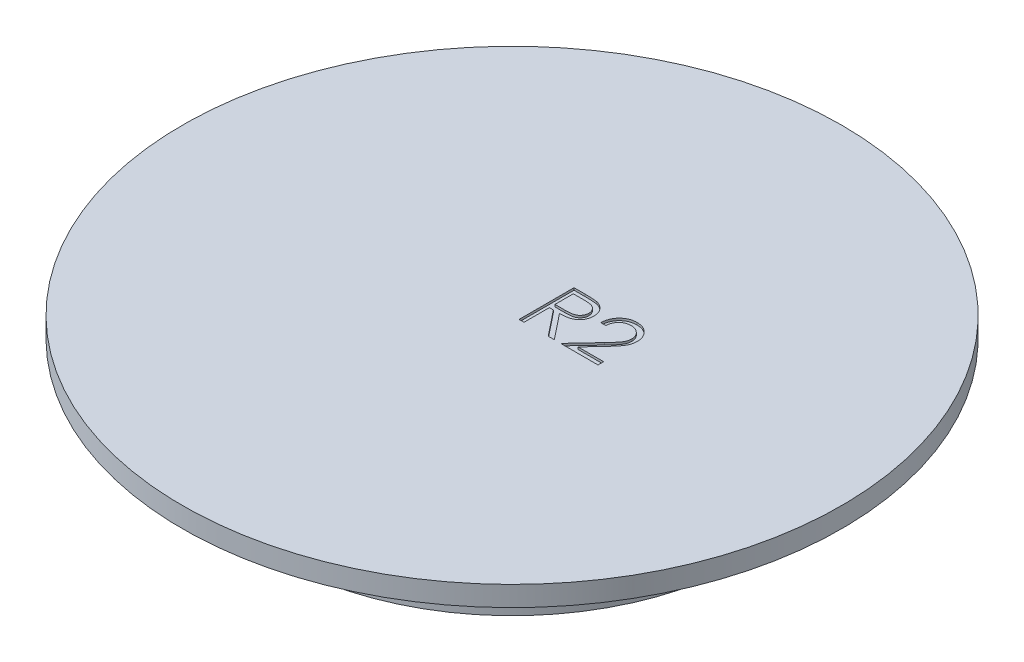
ISO-10303-21;
HEADER;
FILE_DESCRIPTION(('STEP AP214'),'2;1');
FILE_NAME('part.step','',(''),(''),'','','');
FILE_SCHEMA(('AUTOMOTIVE_DESIGN { 1 0 10303 214 1 1 1 1 }'));
ENDSEC;
DATA;
#1=APPLICATION_CONTEXT('core data for automotive mechanical design processes');
#2=APPLICATION_PROTOCOL_DEFINITION('international standard','automotive_design',2000,#1);
#3=PRODUCT_CONTEXT('',#1,'mechanical');
#4=PRODUCT('Part','Part','',(#3));
#5=PRODUCT_RELATED_PRODUCT_CATEGORY('part','',(#4));
#6=PRODUCT_DEFINITION_FORMATION('','',#4);
#7=PRODUCT_DEFINITION_CONTEXT('part definition',#1,'design');
#8=PRODUCT_DEFINITION('design','',#6,#7);
#9=PRODUCT_DEFINITION_SHAPE('','',#8);
#10=(LENGTH_UNIT() NAMED_UNIT(*) SI_UNIT(.MILLI.,.METRE.));
#11=(NAMED_UNIT(*) PLANE_ANGLE_UNIT() SI_UNIT($,.RADIAN.));
#12=(NAMED_UNIT(*) SI_UNIT($,.STERADIAN.) SOLID_ANGLE_UNIT());
#13=UNCERTAINTY_MEASURE_WITH_UNIT(LENGTH_MEASURE(1.E-05),#10,'distance_accuracy_value','');
#14=(GEOMETRIC_REPRESENTATION_CONTEXT(3) GLOBAL_UNCERTAINTY_ASSIGNED_CONTEXT((#13)) GLOBAL_UNIT_ASSIGNED_CONTEXT((#10,
#11,#12)) REPRESENTATION_CONTEXT('',''));
#15=CARTESIAN_POINT('',(0.,0.,0.));
#16=DIRECTION('',(0.,0.,1.));
#17=DIRECTION('',(1.,0.,0.));
#18=AXIS2_PLACEMENT_3D('',#15,#16,#17);
#19=CARTESIAN_POINT('',(0.,30.48,0.));
#20=DIRECTION('',(0.,1.,0.));
#21=DIRECTION('',(0.,0.,1.));
#22=AXIS2_PLACEMENT_3D('',#19,#20,#21);
#23=PLANE('',#22);
#24=CARTESIAN_POINT('',(18.5615384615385,30.48,-9.14847756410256));
#25=CARTESIAN_POINT('',(18.5592316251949,30.48,-9.23513292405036));
#26=CARTESIAN_POINT('',(18.5546852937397,30.48,-9.40591399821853));
#27=CARTESIAN_POINT('',(18.5145616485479,30.48,-9.65630632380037));
#28=CARTESIAN_POINT('',(18.4539263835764,30.48,-9.89784150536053));
#29=CARTESIAN_POINT('',(18.3670393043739,30.48,-10.131262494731));
#30=CARTESIAN_POINT('',(18.2523519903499,30.48,-10.3542224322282));
#31=CARTESIAN_POINT('',(18.1127485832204,30.48,-10.5669927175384));
#32=CARTESIAN_POINT('',(17.9516760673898,30.48,-10.7726926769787));
#33=CARTESIAN_POINT('',(17.7653443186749,30.48,-10.9655632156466));
#34=CARTESIAN_POINT('',(17.5606510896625,30.48,-11.1422064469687));
#35=CARTESIAN_POINT('',(17.3444090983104,30.48,-11.2986852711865));
#36=CARTESIAN_POINT('',(17.1156272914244,30.48,-11.4294557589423));
#37=CARTESIAN_POINT('',(16.8752702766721,30.48,-11.5366564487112));
#38=CARTESIAN_POINT('',(16.624008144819,30.48,-11.6207499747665));
#39=CARTESIAN_POINT('',(16.3613549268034,30.48,-11.6790196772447));
#40=CARTESIAN_POINT('',(16.0880363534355,30.48,-11.7156046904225));
#41=CARTESIAN_POINT('',(15.9014062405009,30.48,-11.7205546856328));
#42=CARTESIAN_POINT('',(15.8063100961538,30.48,-11.7230769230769));
#43=B_SPLINE_CURVE_WITH_KNOTS('',3,(#24,#25,#26,#27,#28,#29,#30,#31,#32,#33,#34,#35,#36,#37,#38,
#39,#40,#41,#42),.UNSPECIFIED.,.F.,.F.,(4,1,1,1,1,1,1,1,1,1,1,1,1,1,1,1,4),(0.,
0.0619654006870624,0.122121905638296,0.180988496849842,0.239933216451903,0.299905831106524,
0.359988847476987,0.421775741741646,0.486575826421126,0.551534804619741,0.61501754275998,
0.677258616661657,0.739729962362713,0.803050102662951,0.866495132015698,0.931973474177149,1.),.UNSPECIFIED.);
#44=CARTESIAN_POINT('',(18.5615384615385,30.48,-9.14847756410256));
#45=VERTEX_POINT('',#44);
#46=CARTESIAN_POINT('',(15.8063100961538,30.48,-11.7230769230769));
#47=VERTEX_POINT('',#46);
#48=EDGE_CURVE('E425',#45,#47,#43,.T.);
#49=ORIENTED_EDGE('',*,*,#48,.T.);
#50=CARTESIAN_POINT('',(15.8063100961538,30.48,-11.7230769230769));
#51=CARTESIAN_POINT('',(15.706993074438,30.48,-11.7204823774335));
#52=CARTESIAN_POINT('',(15.5119508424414,30.48,-11.7153871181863));
#53=CARTESIAN_POINT('',(15.2255874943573,30.48,-11.6797448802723));
#54=CARTESIAN_POINT('',(14.9524076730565,30.48,-11.6182556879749));
#55=CARTESIAN_POINT('',(14.6917241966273,30.48,-11.5341574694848));
#56=CARTESIAN_POINT('',(14.4430959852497,30.48,-11.427265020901));
#57=CARTESIAN_POINT('',(14.2077321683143,30.48,-11.2941264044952));
#58=CARTESIAN_POINT('',(13.9861611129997,30.48,-11.1352548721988));
#59=CARTESIAN_POINT('',(13.7779662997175,30.48,-10.955130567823));
#60=CARTESIAN_POINT('',(13.5861455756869,30.48,-10.7545881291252));
#61=CARTESIAN_POINT('',(13.4176097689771,30.48,-10.5310319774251));
#62=CARTESIAN_POINT('',(13.2703477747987,30.48,-10.2885439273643));
#63=CARTESIAN_POINT('',(13.1418628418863,30.48,-10.0277782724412));
#64=CARTESIAN_POINT('',(13.0375207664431,30.48,-9.74636884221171));
#65=CARTESIAN_POINT('',(12.9577896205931,30.48,-9.44531459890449));
#66=CARTESIAN_POINT('',(12.8947002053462,30.48,-9.12592272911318));
#67=CARTESIAN_POINT('',(12.8736235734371,30.48,-8.90535970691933));
#68=CARTESIAN_POINT('',(12.8628205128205,30.48,-8.79230769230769));
#69=B_SPLINE_CURVE_WITH_KNOTS('',3,(#50,#51,#52,#53,#54,#55,#56,#57,#58,#59,#60,#61,#62,#63,#64,
#65,#66,#67,#68),.UNSPECIFIED.,.F.,.F.,(4,1,1,1,1,1,1,1,1,1,1,1,1,1,1,1,4),(0.,
0.0644386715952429,0.126546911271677,0.18688715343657,0.245877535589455,0.304040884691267,
0.36219121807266,0.420975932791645,0.480660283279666,0.540600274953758,0.600689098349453,
0.661935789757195,0.724442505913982,0.789038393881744,0.856313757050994,0.926352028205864,1.),.UNSPECIFIED.);
#70=CARTESIAN_POINT('',(12.8628205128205,30.48,-8.79230769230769));
#71=VERTEX_POINT('',#70);
#72=EDGE_CURVE('E613',#47,#71,#69,.T.);
#73=ORIENTED_EDGE('',*,*,#72,.T.);
#74=DIRECTION('',(-1.,0.,0.));
#75=VECTOR('',#74,1.);
#76=CARTESIAN_POINT('',(12.8628205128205,30.48,-8.79230769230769));
#77=LINE('',#76,#75);
#78=CARTESIAN_POINT('',(11.7230769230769,30.48,-8.79230769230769));
#79=VERTEX_POINT('',#78);
#80=EDGE_CURVE('E607',#71,#79,#77,.T.);
#81=ORIENTED_EDGE('',*,*,#80,.T.);
#82=CARTESIAN_POINT('',(11.7230769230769,30.48,-8.79230769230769));
#83=CARTESIAN_POINT('',(11.7305051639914,30.48,-8.94351348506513));
#84=CARTESIAN_POINT('',(11.7450940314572,30.48,-9.24047763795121));
#85=CARTESIAN_POINT('',(11.8134138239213,30.48,-9.67345295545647));
#86=CARTESIAN_POINT('',(11.9111707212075,30.48,-10.087308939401));
#87=CARTESIAN_POINT('',(12.0493882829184,30.48,-10.4787226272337));
#88=CARTESIAN_POINT('',(12.2210424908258,30.48,-10.8511548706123));
#89=CARTESIAN_POINT('',(12.4268914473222,30.48,-11.2031263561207));
#90=CARTESIAN_POINT('',(12.6707091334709,30.48,-11.5332943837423));
#91=CARTESIAN_POINT('',(12.9472307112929,30.48,-11.8385981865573));
#92=CARTESIAN_POINT('',(13.2475626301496,30.48,-12.1186788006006));
#93=CARTESIAN_POINT('',(13.5716156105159,30.48,-12.3605421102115));
#94=CARTESIAN_POINT('',(13.9121389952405,30.48,-12.5648948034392));
#95=CARTESIAN_POINT('',(14.2680996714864,30.48,-12.7357324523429));
#96=CARTESIAN_POINT('',(14.6435137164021,30.48,-12.8639656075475));
#97=CARTESIAN_POINT('',(15.034974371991,30.48,-12.959112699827));
#98=CARTESIAN_POINT('',(15.4442015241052,30.48,-13.0163582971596));
#99=CARTESIAN_POINT('',(15.7230210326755,30.48,-13.0225115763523));
#100=CARTESIAN_POINT('',(15.8648237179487,30.48,-13.025641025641));
#101=B_SPLINE_CURVE_WITH_KNOTS('',3,(#82,#83,#84,#85,#86,#87,#88,#89,#90,#91,#92,#93,#94,#95,
#96,#97,#98,#99,#100),.UNSPECIFIED.,.F.,.F.,(4,1,1,1,1,1,1,1,1,1,1,1,1,1,1,1,4),(0.,
0.0687907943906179,0.135103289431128,0.198978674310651,0.261904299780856,0.323494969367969,
0.385195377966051,0.446969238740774,0.509764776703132,0.572250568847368,0.633405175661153,
0.693251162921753,0.75258316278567,0.812579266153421,0.873275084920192,0.935549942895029,1.),.UNSPECIFIED.);
#102=CARTESIAN_POINT('',(15.8648237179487,30.48,-13.025641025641));
#103=VERTEX_POINT('',#102);
#104=EDGE_CURVE('E599',#79,#103,#101,.T.);
#105=ORIENTED_EDGE('',*,*,#104,.T.);
#106=CARTESIAN_POINT('',(15.8648237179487,30.48,-13.025641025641));
#107=CARTESIAN_POINT('',(16.0040813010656,30.48,-13.0223809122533));
#108=CARTESIAN_POINT('',(16.2777174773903,30.48,-13.0159749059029));
#109=CARTESIAN_POINT('',(16.6770853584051,30.48,-12.9609620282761));
#110=CARTESIAN_POINT('',(17.0572772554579,30.48,-12.8747994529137));
#111=CARTESIAN_POINT('',(17.417550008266,30.48,-12.7539120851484));
#112=CARTESIAN_POINT('',(17.7550291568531,30.48,-12.5914085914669));
#113=CARTESIAN_POINT('',(18.072249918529,30.48,-12.3962003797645));
#114=CARTESIAN_POINT('',(18.372988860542,30.48,-12.1704312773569));
#115=CARTESIAN_POINT('',(18.6437049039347,30.48,-11.9046245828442));
#116=CARTESIAN_POINT('',(18.8922913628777,30.48,-11.6208616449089));
#117=CARTESIAN_POINT('',(19.1067481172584,30.48,-11.3179198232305));
#118=CARTESIAN_POINT('',(19.2904015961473,30.48,-11.0050307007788));
#119=CARTESIAN_POINT('',(19.4434826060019,30.48,-10.6798083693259));
#120=CARTESIAN_POINT('',(19.5561720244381,30.48,-10.339190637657));
#121=CARTESIAN_POINT('',(19.6417272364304,30.48,-9.98813650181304));
#122=CARTESIAN_POINT('',(19.6900867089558,30.48,-9.62301218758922));
#123=CARTESIAN_POINT('',(19.6975086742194,30.48,-9.3758826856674));
#124=CARTESIAN_POINT('',(19.7012820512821,30.48,-9.25024038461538));
#125=B_SPLINE_CURVE_WITH_KNOTS('',3,(#106,#107,#108,#109,#110,#111,#112,#113,#114,#115,#116,
#117,#118,#119,#120,#121,#122,#123,#124),.UNSPECIFIED.,.F.,.F.,(4,1,1,1,1,1,1,1,1,1,1,1,1,1,1,1,
4),(0.,0.0694754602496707,0.136516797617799,0.200788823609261,0.263829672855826,
0.32573502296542,0.387290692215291,0.449509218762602,0.512967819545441,0.576275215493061,
0.637580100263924,0.697902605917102,0.757172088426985,0.816598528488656,0.87665317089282,
0.93728964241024,1.),.UNSPECIFIED.);
#126=CARTESIAN_POINT('',(19.7012820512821,30.48,-9.25024038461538));
#127=VERTEX_POINT('',#126);
#128=EDGE_CURVE('E591',#103,#127,#125,.T.);
#129=ORIENTED_EDGE('',*,*,#128,.T.);
#130=CARTESIAN_POINT('',(19.7012820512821,30.48,-9.25024038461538));
#131=CARTESIAN_POINT('',(19.69513792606,30.48,-9.07335538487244));
#132=CARTESIAN_POINT('',(19.6829574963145,30.48,-8.72268946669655));
#133=CARTESIAN_POINT('',(19.5787653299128,30.48,-8.20737839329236));
#134=CARTESIAN_POINT('',(19.4160365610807,30.48,-7.70811084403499));
#135=CARTESIAN_POINT('',(19.2201032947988,30.48,-7.30629263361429));
#136=CARTESIAN_POINT('',(19.0224461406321,30.48,-6.98250252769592));
#137=CARTESIAN_POINT('',(18.844328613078,30.48,-6.71591608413));
#138=CARTESIAN_POINT('',(18.635813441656,30.48,-6.42887624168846));
#139=CARTESIAN_POINT('',(18.3938657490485,30.48,-6.12234418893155));
#140=CARTESIAN_POINT('',(18.1234904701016,30.48,-5.79391890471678));
#141=CARTESIAN_POINT('',(17.8222386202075,30.48,-5.44379878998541));
#142=CARTESIAN_POINT('',(17.4879619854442,30.48,-5.07560122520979));
#143=CARTESIAN_POINT('',(17.2533439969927,30.48,-4.82412090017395));
#144=CARTESIAN_POINT('',(17.1317708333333,30.48,-4.69381009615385));
#145=B_SPLINE_CURVE_WITH_KNOTS('',3,(#130,#131,#132,#133,#134,#135,#136,#137,#138,#139,#140,
#141,#142,#143,#144),.UNSPECIFIED.,.F.,.F.,(4,1,1,1,1,1,1,1,1,1,1,1,4),(0.,0.0987021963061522,
0.195672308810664,0.292422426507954,0.391342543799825,0.444462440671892,0.504228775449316,
0.570352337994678,0.642545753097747,0.722287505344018,0.807921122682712,0.900469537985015,1.),.UNSPECIFIED.);
#146=CARTESIAN_POINT('',(17.1317708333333,30.48,-4.69381009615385));
#147=VERTEX_POINT('',#146);
#148=EDGE_CURVE('E586',#127,#147,#145,.T.);
#149=ORIENTED_EDGE('',*,*,#148,.T.);
#150=DIRECTION('',(-0.683740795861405,0.,0.729724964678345));
#151=VECTOR('',#150,1.);
#152=CARTESIAN_POINT('',(17.1317708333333,30.48,-4.69381009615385));
#153=LINE('',#152,#151);
#154=CARTESIAN_POINT('',(13.9542267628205,30.48,-1.3025641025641));
#155=VERTEX_POINT('',#154);
#156=EDGE_CURVE('E583',#147,#155,#153,.T.);
#157=ORIENTED_EDGE('',*,*,#156,.T.);
#158=DIRECTION('',(1.,0.,0.));
#159=VECTOR('',#158,1.);
#160=CARTESIAN_POINT('',(13.9542267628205,30.48,-1.3025641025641));
#161=LINE('',#160,#159);
#162=CARTESIAN_POINT('',(19.8641025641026,30.48,-1.3025641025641));
#163=VERTEX_POINT('',#162);
#164=EDGE_CURVE('E580',#155,#163,#161,.T.);
#165=ORIENTED_EDGE('',*,*,#164,.T.);
#166=DIRECTION('',(0.,0.,1.));
#167=VECTOR('',#166,1.);
#168=CARTESIAN_POINT('',(19.8641025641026,30.48,-1.3025641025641));
#169=LINE('',#168,#167);
#170=CARTESIAN_POINT('',(19.8641025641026,30.48,0.));
#171=VERTEX_POINT('',#170);
#172=EDGE_CURVE('E577',#163,#171,#169,.T.);
#173=ORIENTED_EDGE('',*,*,#172,.T.);
#174=DIRECTION('',(-1.,0.,0.));
#175=VECTOR('',#174,1.);
#176=CARTESIAN_POINT('',(19.8641025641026,30.48,0.));
#177=LINE('',#176,#175);
#178=CARTESIAN_POINT('',(11.2346153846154,30.48,0.));
#179=VERTEX_POINT('',#178);
#180=EDGE_CURVE('E574',#171,#179,#177,.T.);
#181=ORIENTED_EDGE('',*,*,#180,.T.);
#182=DIRECTION('',(0.683776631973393,0.,-0.729691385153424));
#183=VECTOR('',#182,1.);
#184=CARTESIAN_POINT('',(11.2346153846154,30.48,0.));
#185=LINE('',#184,#183);
#186=CARTESIAN_POINT('',(16.1599358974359,30.48,-5.25604967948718));
#187=VERTEX_POINT('',#186);
#188=EDGE_CURVE('E568',#179,#187,#185,.T.);
#189=ORIENTED_EDGE('',*,*,#188,.T.);
#190=CARTESIAN_POINT('',(16.1599358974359,30.48,-5.25604967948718));
#191=CARTESIAN_POINT('',(16.2798525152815,30.48,-5.38122924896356));
#192=CARTESIAN_POINT('',(16.5101877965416,30.48,-5.62167358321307));
#193=CARTESIAN_POINT('',(16.8359702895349,30.48,-5.97271232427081));
#194=CARTESIAN_POINT('',(17.1285746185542,30.48,-6.29837494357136));
#195=CARTESIAN_POINT('',(17.3898948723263,30.48,-6.59804613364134));
#196=CARTESIAN_POINT('',(17.6142621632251,30.48,-6.87610925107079));
#197=CARTESIAN_POINT('',(17.8133699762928,30.48,-7.12355860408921));
#198=CARTESIAN_POINT('',(17.9729022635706,30.48,-7.35126760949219));
#199=CARTESIAN_POINT('',(18.1460409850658,30.48,-7.61521212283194));
#200=CARTESIAN_POINT('',(18.313731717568,30.48,-7.93747395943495));
#201=CARTESIAN_POINT('',(18.4578308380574,30.48,-8.33129620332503));
#202=CARTESIAN_POINT('',(18.5456961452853,30.48,-8.7367065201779));
#203=CARTESIAN_POINT('',(18.5562365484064,30.48,-9.01067105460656));
#204=CARTESIAN_POINT('',(18.5615384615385,30.48,-9.14847756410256));
#205=B_SPLINE_CURVE_WITH_KNOTS('',3,(#190,#191,#192,#193,#194,#195,#196,#197,#198,#199,#200,
#201,#202,#203,#204),.UNSPECIFIED.,.F.,.F.,(4,1,1,1,1,1,1,1,1,1,1,1,4),(0.,0.110802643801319,
0.21282920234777,0.306101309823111,0.39064732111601,0.466924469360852,0.534481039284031,
0.593586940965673,0.644557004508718,0.736200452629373,0.825024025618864,0.911985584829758,1.),.UNSPECIFIED.);
#206=EDGE_CURVE('E560',#187,#45,#205,.T.);
#207=ORIENTED_EDGE('',*,*,#206,.T.);
#208=EDGE_LOOP('',(#49,#73,#81,#105,#129,#149,#157,#165,#173,#181,#189,#207));
#209=FACE_BOUND('',#208,.T.);
#210=CARTESIAN_POINT('',(0.,30.48,0.));
#211=DIRECTION('',(0.,-1.,0.));
#212=DIRECTION('',(0.,0.,-1.));
#213=AXIS2_PLACEMENT_3D('',#210,#211,#212);
#214=CIRCLE('',#213,76.2);
#215=CARTESIAN_POINT('',(0.,30.48,-76.2));
#216=VERTEX_POINT('',#215);
#217=EDGE_CURVE('E525',#216,#216,#214,.T.);
#218=ORIENTED_EDGE('',*,*,#217,.F.);
#219=EDGE_LOOP('',(#218));
#220=FACE_BOUND('',#219,.T.);
#221=DIRECTION('',(-1.,0.,0.));
#222=VECTOR('',#221,1.);
#223=CARTESIAN_POINT('',(2.76794871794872,30.48,0.));
#224=LINE('',#223,#222);
#225=CARTESIAN_POINT('',(2.76794871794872,30.48,0.));
#226=VERTEX_POINT('',#225);
#227=CARTESIAN_POINT('',(1.62820512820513,30.48,0.));
#228=VERTEX_POINT('',#227);
#229=EDGE_CURVE('E393',#226,#228,#224,.T.);
#230=ORIENTED_EDGE('',*,*,#229,.T.);
#231=DIRECTION('',(0.,0.,-1.));
#232=VECTOR('',#231,1.);
#233=CARTESIAN_POINT('',(1.62820512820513,30.48,0.));
#234=LINE('',#233,#232);
#235=CARTESIAN_POINT('',(1.62820512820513,30.48,-12.7));
#236=VERTEX_POINT('',#235);
#237=EDGE_CURVE('E56',#228,#236,#234,.T.);
#238=ORIENTED_EDGE('',*,*,#237,.T.);
#239=DIRECTION('',(1.,0.,0.));
#240=VECTOR('',#239,1.);
#241=CARTESIAN_POINT('',(1.62820512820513,30.48,-12.7));
#242=LINE('',#241,#240);
#243=CARTESIAN_POINT('',(4.16973157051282,30.48,-12.7));
#244=VERTEX_POINT('',#243);
#245=EDGE_CURVE('E351',#236,#244,#242,.T.);
#246=ORIENTED_EDGE('',*,*,#245,.T.);
#247=CARTESIAN_POINT('',(4.16973157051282,30.48,-12.7));
#248=CARTESIAN_POINT('',(4.33933509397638,30.48,-12.6994354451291));
#249=CARTESIAN_POINT('',(4.66499264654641,30.48,-12.6983514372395));
#250=CARTESIAN_POINT('',(5.13152994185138,30.48,-12.6923070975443));
#251=CARTESIAN_POINT('',(5.55544540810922,30.48,-12.6749830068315));
#252=CARTESIAN_POINT('',(5.93651739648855,30.48,-12.6600747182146));
#253=CARTESIAN_POINT('',(6.274738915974,30.48,-12.6328896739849));
#254=CARTESIAN_POINT('',(6.57114708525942,30.48,-12.6069067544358));
#255=CARTESIAN_POINT('',(6.8243767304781,30.48,-12.5728937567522));
#256=CARTESIAN_POINT('',(6.97766881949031,30.48,-12.5413055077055));
#257=CARTESIAN_POINT('',(7.04707532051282,30.48,-12.5270032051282));
#258=B_SPLINE_CURVE_WITH_KNOTS('',3,(#247,#248,#249,#250,#251,#252,#253,#254,#255,#256,#257),
.UNSPECIFIED.,.F.,.F.,(4,1,1,1,1,1,1,1,4),(0.,0.1762577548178,0.338434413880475,
0.484822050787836,0.617157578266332,0.734698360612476,0.83738518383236,0.926372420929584,1.),.UNSPECIFIED.);
#259=CARTESIAN_POINT('',(7.04707532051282,30.48,-12.5270032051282));
#260=VERTEX_POINT('',#259);
#261=EDGE_CURVE('E354',#244,#260,#258,.T.);
#262=ORIENTED_EDGE('',*,*,#261,.T.);
#263=CARTESIAN_POINT('',(7.04707532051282,30.48,-12.5270032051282));
#264=CARTESIAN_POINT('',(7.13999078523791,30.48,-12.5040460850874));
#265=CARTESIAN_POINT('',(7.3238395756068,30.48,-12.4586215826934));
#266=CARTESIAN_POINT('',(7.58854410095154,30.48,-12.3626110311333));
#267=CARTESIAN_POINT('',(7.84078179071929,30.48,-12.2515055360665));
#268=CARTESIAN_POINT('',(8.0795048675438,30.48,-12.1210086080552));
#269=CARTESIAN_POINT('',(8.30351759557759,30.48,-11.9701515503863));
#270=CARTESIAN_POINT('',(8.51512975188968,30.48,-11.8015386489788));
#271=CARTESIAN_POINT('',(8.71530157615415,30.48,-11.6160925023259));
#272=CARTESIAN_POINT('',(8.8959377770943,30.48,-11.4091375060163));
#273=CARTESIAN_POINT('',(9.06625947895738,30.48,-11.192016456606));
#274=CARTESIAN_POINT('',(9.20990963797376,30.48,-10.9572342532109));
#275=CARTESIAN_POINT('',(9.33374000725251,30.48,-10.7117195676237));
#276=CARTESIAN_POINT('',(9.43233016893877,30.48,-10.452975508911));
#277=CARTESIAN_POINT('',(9.51171595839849,30.48,-10.1835113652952));
#278=CARTESIAN_POINT('',(9.56769116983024,30.48,-9.90088630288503));
#279=CARTESIAN_POINT('',(9.60125976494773,30.48,-9.60638790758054));
#280=CARTESIAN_POINT('',(9.60467735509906,30.48,-9.40551778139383));
#281=CARTESIAN_POINT('',(9.60641025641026,30.48,-9.30366586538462));
#282=B_SPLINE_CURVE_WITH_KNOTS('',3,(#263,#264,#265,#266,#267,#268,#269,#270,#271,#272,#273,
#274,#275,#276,#277,#278,#279,#280,#281),.UNSPECIFIED.,.F.,.F.,(4,1,1,1,1,1,1,1,1,1,1,1,1,1,1,1,
4),(0.,0.0642168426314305,0.127063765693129,0.18874453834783,0.249132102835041,
0.309452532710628,0.369826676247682,0.430650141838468,0.492351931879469,0.554072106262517,
0.615689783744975,0.676797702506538,0.738439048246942,0.801316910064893,0.865184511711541,
0.931641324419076,1.),.UNSPECIFIED.);
#283=CARTESIAN_POINT('',(9.60641025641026,30.48,-9.30366586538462));
#284=VERTEX_POINT('',#283);
#285=EDGE_CURVE('E359',#260,#284,#282,.T.);
#286=ORIENTED_EDGE('',*,*,#285,.T.);
#287=CARTESIAN_POINT('',(9.60641025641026,30.48,-9.30366586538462));
#288=CARTESIAN_POINT('',(9.60107989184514,30.48,-9.1344470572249));
#289=CARTESIAN_POINT('',(9.59067896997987,30.48,-8.80425733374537));
#290=CARTESIAN_POINT('',(9.49370502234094,30.48,-8.32506499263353));
#291=CARTESIAN_POINT('',(9.33485879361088,30.48,-7.87806376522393));
#292=CARTESIAN_POINT('',(9.11597143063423,30.48,-7.46381647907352));
#293=CARTESIAN_POINT('',(8.83722647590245,30.48,-7.09039785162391));
#294=CARTESIAN_POINT('',(8.50221937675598,30.48,-6.76240962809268));
#295=CARTESIAN_POINT('',(8.11076324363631,30.48,-6.48794480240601));
#296=CARTESIAN_POINT('',(7.74634829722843,30.48,-6.2976160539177));
#297=CARTESIAN_POINT('',(7.42444248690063,30.48,-6.1757217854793));
#298=CARTESIAN_POINT('',(7.15943589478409,30.48,-6.08995556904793));
#299=CARTESIAN_POINT('',(6.87035857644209,30.48,-6.02369072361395));
#300=CARTESIAN_POINT('',(6.55998024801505,30.48,-5.96432681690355));
#301=CARTESIAN_POINT('',(6.22700926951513,30.48,-5.91950781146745));
#302=CARTESIAN_POINT('',(5.87224369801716,30.48,-5.88668159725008));
#303=CARTESIAN_POINT('',(5.49543051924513,30.48,-5.86616547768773));
#304=CARTESIAN_POINT('',(5.23657161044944,30.48,-5.863110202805));
#305=CARTESIAN_POINT('',(5.10340544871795,30.48,-5.86153846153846));
#306=B_SPLINE_CURVE_WITH_KNOTS('',3,(#287,#288,#289,#290,#291,#292,#293,#294,#295,#296,#297,
#298,#299,#300,#301,#302,#303,#304,#305),.UNSPECIFIED.,.F.,.F.,(4,1,1,1,1,1,1,1,1,1,1,1,1,1,1,1,
4),(0.,0.0787802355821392,0.153720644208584,0.226713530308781,0.299191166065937,
0.371189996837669,0.44300641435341,0.516689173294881,0.593217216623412,0.633872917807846,
0.676989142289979,0.722899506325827,0.771958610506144,0.824211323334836,0.879378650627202,
0.937948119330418,1.),.UNSPECIFIED.);
#307=CARTESIAN_POINT('',(5.10340544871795,30.48,-5.86153846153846));
#308=VERTEX_POINT('',#307);
#309=EDGE_CURVE('E367',#284,#308,#306,.T.);
#310=ORIENTED_EDGE('',*,*,#309,.T.);
#311=DIRECTION('',(0.622788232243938,0.,0.782390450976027));
#312=VECTOR('',#311,1.);
#313=CARTESIAN_POINT('',(5.10340544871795,30.48,-5.86153846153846));
#314=LINE('',#313,#312);
#315=CARTESIAN_POINT('',(9.76923076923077,30.48,0.));
#316=VERTEX_POINT('',#315);
#317=EDGE_CURVE('E375',#308,#316,#314,.T.);
#318=ORIENTED_EDGE('',*,*,#317,.T.);
#319=DIRECTION('',(-1.,0.,0.));
#320=VECTOR('',#319,1.);
#321=CARTESIAN_POINT('',(9.76923076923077,30.48,0.));
#322=LINE('',#321,#320);
#323=CARTESIAN_POINT('',(8.35981570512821,30.48,0.));
#324=VERTEX_POINT('',#323);
#325=EDGE_CURVE('E381',#316,#324,#322,.T.);
#326=ORIENTED_EDGE('',*,*,#325,.T.);
#327=DIRECTION('',(-0.622788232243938,0.,-0.782390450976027));
#328=VECTOR('',#327,1.);
#329=CARTESIAN_POINT('',(8.35981570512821,30.48,0.));
#330=LINE('',#329,#328);
#331=CARTESIAN_POINT('',(3.69399038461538,30.48,-5.86153846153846));
#332=VERTEX_POINT('',#331);
#333=EDGE_CURVE('E384',#324,#332,#330,.T.);
#334=ORIENTED_EDGE('',*,*,#333,.T.);
#335=DIRECTION('',(-1.,0.,0.));
#336=VECTOR('',#335,1.);
#337=CARTESIAN_POINT('',(3.69399038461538,30.48,-5.86153846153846));
#338=LINE('',#337,#336);
#339=CARTESIAN_POINT('',(2.76794871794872,30.48,-5.86153846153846));
#340=VERTEX_POINT('',#339);
#341=EDGE_CURVE('E387',#332,#340,#338,.T.);
#342=ORIENTED_EDGE('',*,*,#341,.T.);
#343=DIRECTION('',(0.,0.,1.));
#344=VECTOR('',#343,1.);
#345=CARTESIAN_POINT('',(2.76794871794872,30.48,-5.86153846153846));
#346=LINE('',#345,#344);
#347=EDGE_CURVE('E390',#340,#226,#346,.T.);
#348=ORIENTED_EDGE('',*,*,#347,.T.);
#349=EDGE_LOOP('',(#230,#238,#246,#262,#286,#310,#318,#326,#334,#342,#348));
#350=FACE_BOUND('',#349,.T.);
#351=ADVANCED_FACE('F38',(#209,#220,#350),#23,.T.);
#352=CARTESIAN_POINT('',(0.,30.48,0.));
#353=DIRECTION('',(0.,-1.,0.));
#354=DIRECTION('',(0.,0.,-1.));
#355=AXIS2_PLACEMENT_3D('',#352,#353,#354);
#356=CYLINDRICAL_SURFACE('',#355,54.737);
#357=CARTESIAN_POINT('',(0.,23.2904017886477,0.));
#358=DIRECTION('',(0.,-1.,0.));
#359=DIRECTION('',(0.,0.,-1.));
#360=AXIS2_PLACEMENT_3D('',#357,#358,#359);
#361=CIRCLE('',#360,54.737);
#362=CARTESIAN_POINT('',(0.,23.2904017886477,-54.737));
#363=VERTEX_POINT('',#362);
#364=EDGE_CURVE('E488',#363,#363,#361,.T.);
#365=CARTESIAN_POINT('',(0.,9.03134281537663,0.));
#366=DIRECTION('',(0.,-1.,0.));
#367=DIRECTION('',(0.,0.,-1.));
#368=AXIS2_PLACEMENT_3D('',#365,#366,#367);
#369=CIRCLE('',#368,54.737);
#370=CARTESIAN_POINT('',(0.,9.03134281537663,-54.737));
#371=VERTEX_POINT('',#370);
#372=EDGE_CURVE('E48',#371,#371,#369,.F.);
#373=CARTESIAN_POINT('',(0.,23.2904017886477,-54.737));
#374=CARTESIAN_POINT('',(0.,23.1418699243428,-54.737));
#375=CARTESIAN_POINT('',(0.,22.9933380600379,-54.737));
#376=CARTESIAN_POINT('',(0.,22.6962743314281,-54.737));
#377=CARTESIAN_POINT('',(0.,22.5477424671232,-54.737));
#378=CARTESIAN_POINT('',(0.,22.2506787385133,-54.737));
#379=CARTESIAN_POINT('',(0.,22.1021468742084,-54.737));
#380=CARTESIAN_POINT('',(0.,21.8050831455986,-54.737));
#381=CARTESIAN_POINT('',(0.,21.6565512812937,-54.737));
#382=CARTESIAN_POINT('',(0.,21.3594875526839,-54.737));
#383=CARTESIAN_POINT('',(0.,21.210955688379,-54.737));
#384=CARTESIAN_POINT('',(0.,20.9138919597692,-54.737));
#385=CARTESIAN_POINT('',(0.,20.7653600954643,-54.737));
#386=CARTESIAN_POINT('',(0.,20.4682963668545,-54.737));
#387=CARTESIAN_POINT('',(0.,20.3197645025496,-54.737));
#388=CARTESIAN_POINT('',(0.,20.0227007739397,-54.737));
#389=CARTESIAN_POINT('',(0.,19.8741689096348,-54.737));
#390=CARTESIAN_POINT('',(0.,19.577105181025,-54.737));
#391=CARTESIAN_POINT('',(0.,19.4285733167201,-54.737));
#392=CARTESIAN_POINT('',(0.,19.1315095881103,-54.737));
#393=CARTESIAN_POINT('',(0.,18.9829777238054,-54.737));
#394=CARTESIAN_POINT('',(0.,18.6859139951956,-54.737));
#395=CARTESIAN_POINT('',(0.,18.5373821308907,-54.737));
#396=CARTESIAN_POINT('',(0.,18.2403184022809,-54.737));
#397=CARTESIAN_POINT('',(0.,18.0917865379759,-54.737));
#398=CARTESIAN_POINT('',(0.,17.7947228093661,-54.737));
#399=CARTESIAN_POINT('',(0.,17.6461909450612,-54.737));
#400=CARTESIAN_POINT('',(0.,17.3491272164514,-54.737));
#401=CARTESIAN_POINT('',(0.,17.2005953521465,-54.737));
#402=CARTESIAN_POINT('',(0.,16.9035316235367,-54.737));
#403=CARTESIAN_POINT('',(0.,16.7549997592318,-54.737));
#404=CARTESIAN_POINT('',(0.,16.457936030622,-54.737));
#405=CARTESIAN_POINT('',(0.,16.3094041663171,-54.737));
#406=CARTESIAN_POINT('',(0.,16.0123404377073,-54.737));
#407=CARTESIAN_POINT('',(0.,15.8638085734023,-54.737));
#408=CARTESIAN_POINT('',(0.,15.5667448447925,-54.737));
#409=CARTESIAN_POINT('',(0.,15.4182129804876,-54.737));
#410=CARTESIAN_POINT('',(0.,15.1211492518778,-54.737));
#411=CARTESIAN_POINT('',(0.,14.9726173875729,-54.737));
#412=CARTESIAN_POINT('',(0.,14.6755536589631,-54.737));
#413=CARTESIAN_POINT('',(0.,14.5270217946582,-54.737));
#414=CARTESIAN_POINT('',(0.,14.2299580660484,-54.737));
#415=CARTESIAN_POINT('',(0.,14.0814262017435,-54.737));
#416=CARTESIAN_POINT('',(0.,13.7843624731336,-54.737));
#417=CARTESIAN_POINT('',(0.,13.6358306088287,-54.737));
#418=CARTESIAN_POINT('',(0.,13.3387668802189,-54.737));
#419=CARTESIAN_POINT('',(0.,13.190235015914,-54.737));
#420=CARTESIAN_POINT('',(0.,12.8931712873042,-54.737));
#421=CARTESIAN_POINT('',(0.,12.7446394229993,-54.737));
#422=CARTESIAN_POINT('',(0.,12.4475756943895,-54.737));
#423=CARTESIAN_POINT('',(0.,12.2990438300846,-54.737));
#424=CARTESIAN_POINT('',(0.,12.0019801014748,-54.737));
#425=CARTESIAN_POINT('',(0.,11.8534482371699,-54.737));
#426=CARTESIAN_POINT('',(0.,11.55638450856,-54.737));
#427=CARTESIAN_POINT('',(0.,11.4078526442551,-54.737));
#428=CARTESIAN_POINT('',(0.,11.1107889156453,-54.737));
#429=CARTESIAN_POINT('',(0.,10.9622570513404,-54.737));
#430=CARTESIAN_POINT('',(0.,10.6651933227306,-54.737));
#431=CARTESIAN_POINT('',(0.,10.5166614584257,-54.737));
#432=CARTESIAN_POINT('',(0.,10.2195977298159,-54.737));
#433=CARTESIAN_POINT('',(0.,10.071065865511,-54.737));
#434=CARTESIAN_POINT('',(0.,9.77400213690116,-54.737));
#435=CARTESIAN_POINT('',(0.,9.62547027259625,-54.737));
#436=CARTESIAN_POINT('',(0.,9.32840654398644,-54.737));
#437=CARTESIAN_POINT('',(0.,9.17987467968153,-54.737));
#438=CARTESIAN_POINT('',(0.,9.03134281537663,-54.737));
#439=B_SPLINE_CURVE_WITH_KNOTS('',3,(#373,#374,#375,#376,#377,#378,#379,#380,#381,#382,#383,
#384,#385,#386,#387,#388,#389,#390,#391,#392,#393,#394,#395,#396,#397,#398,#399,#400,#401,#402,
#403,#404,#405,#406,#407,#408,#409,#410,#411,#412,#413,#414,#415,#416,#417,#418,#419,#420,#421,
#422,#423,#424,#425,#426,#427,#428,#429,#430,#431,#432,#433,#434,#435,#436,#437,#438),
.UNSPECIFIED.,.F.,.F.,(4,2,2,2,2,2,2,2,2,2,2,2,2,2,2,2,2,2,2,2,2,2,2,2,2,2,2,2,2,2,2,2,4),(0.,
0.445595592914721,0.891191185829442,1.33678677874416,1.78238237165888,2.2279779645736,
2.67357355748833,3.11916915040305,3.56476474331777,4.01036033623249,4.45595592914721,
4.90155152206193,5.34714711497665,5.79274270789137,6.23833830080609,6.68393389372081,
7.12952948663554,7.57512507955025,8.02072067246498,8.4663162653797,8.91191185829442,
9.35750745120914,9.80310304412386,10.2486986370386,10.6942942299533,11.139889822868,
11.5854854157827,12.0310810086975,12.4766766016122,12.9222721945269,13.3678677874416,
13.8134633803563,14.2590589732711),.UNSPECIFIED.);
#440=EDGE_CURVE('BSEAM471',#363,#371,#439,.T.);
#441=ORIENTED_EDGE('',*,*,#364,.T.);
#442=ORIENTED_EDGE('',*,*,#372,.T.);
#443=ORIENTED_EDGE('',*,*,#440,.T.);
#444=ORIENTED_EDGE('',*,*,#440,.F.);
#445=EDGE_LOOP('',(#441,#443,#442,#444));
#446=FACE_BOUND('',#445,.T.);
#447=ADVANCED_FACE('F471',(#446),#356,.T.);
#448=CARTESIAN_POINT('',(0.,8.89,0.));
#449=DIRECTION('',(0.,1.,0.));
#450=DIRECTION('',(0.,0.,-1.));
#451=AXIS2_PLACEMENT_3D('',#448,#449,#450);
#452=TOROIDAL_SURFACE('',#451,53.4748897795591,1.27);
#453=CARTESIAN_POINT('',(0.,10.16,0.));
#454=DIRECTION('',(0.,1.,0.));
#455=DIRECTION('',(0.,0.,-1.));
#456=AXIS2_PLACEMENT_3D('',#453,#454,#455);
#457=CIRCLE('',#456,53.4748897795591);
#458=CARTESIAN_POINT('',(0.,10.16,-53.4748897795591));
#459=VERTEX_POINT('',#458);
#460=EDGE_CURVE('E504',#459,#459,#457,.T.);
#461=ORIENTED_EDGE('',*,*,#460,.T.);
#462=EDGE_LOOP('',(#461));
#463=FACE_BOUND('',#462,.T.);
#464=ORIENTED_EDGE('',*,*,#372,.F.);
#465=EDGE_LOOP('',(#464));
#466=FACE_BOUND('',#465,.T.);
#467=ADVANCED_FACE('F463',(#463,#466),#452,.F.);
#468=CARTESIAN_POINT('',(0.,-0.762000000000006,0.));
#469=DIRECTION('',(0.,1.,0.));
#470=DIRECTION('',(0.,0.,-1.));
#471=AXIS2_PLACEMENT_3D('',#468,#469,#470);
#472=CONICAL_SURFACE('',#471,38.1,0.435353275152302);
#473=CARTESIAN_POINT('',(0.,9.42559805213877,0.));
#474=DIRECTION('',(0.,-1.,0.));
#475=DIRECTION('',(0.,0.,1.));
#476=AXIS2_PLACEMENT_3D('',#473,#474,#475);
#477=CIRCLE('',#476,42.8384176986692);
#478=CARTESIAN_POINT('',(0.,9.42559805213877,42.8384176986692));
#479=VERTEX_POINT('',#478);
#480=EDGE_CURVE('E498',#479,#479,#477,.F.);
#481=ORIENTED_EDGE('',*,*,#480,.F.);
#482=EDGE_LOOP('',(#481));
#483=FACE_BOUND('',#482,.T.);
#484=CARTESIAN_POINT('',(0.,0.,0.));
#485=DIRECTION('',(0.,1.,0.));
#486=DIRECTION('',(0.,0.,1.));
#487=AXIS2_PLACEMENT_3D('',#484,#485,#486);
#488=CIRCLE('',#487,38.4544186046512);
#489=CARTESIAN_POINT('',(0.,0.,38.4544186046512));
#490=VERTEX_POINT('',#489);
#491=EDGE_CURVE('E493',#490,#490,#488,.F.);
#492=ORIENTED_EDGE('',*,*,#491,.F.);
#493=EDGE_LOOP('',(#492));
#494=FACE_BOUND('',#493,.T.);
#495=ADVANCED_FACE('F459',(#483,#494),#472,.T.);
#496=CARTESIAN_POINT('',(-43.18,10.16,0.));
#497=DIRECTION('',(0.,1.,0.));
#498=DIRECTION('',(0.,0.,-1.));
#499=AXIS2_PLACEMENT_3D('',#496,#497,#498);
#500=PLANE('',#499);
#501=ORIENTED_EDGE('',*,*,#460,.F.);
#502=EDGE_LOOP('',(#501));
#503=FACE_BOUND('',#502,.T.);
#504=CARTESIAN_POINT('',(0.,10.16,0.));
#505=DIRECTION('',(0.,1.,0.));
#506=DIRECTION('',(0.,0.,-1.));
#507=AXIS2_PLACEMENT_3D('',#504,#505,#506);
#508=CIRCLE('',#507,43.9899535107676);
#509=CARTESIAN_POINT('',(0.,10.16,-43.9899535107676));
#510=VERTEX_POINT('',#509);
#511=EDGE_CURVE('E507',#510,#510,#508,.F.);
#512=ORIENTED_EDGE('',*,*,#511,.F.);
#513=EDGE_LOOP('',(#512));
#514=FACE_BOUND('',#513,.T.);
#515=ADVANCED_FACE('F462',(#503,#514),#500,.F.);
#516=CARTESIAN_POINT('',(0.,8.89,0.));
#517=DIRECTION('',(0.,1.,0.));
#518=DIRECTION('',(0.,0.,-1.));
#519=AXIS2_PLACEMENT_3D('',#516,#517,#518);
#520=TOROIDAL_SURFACE('',#519,43.9899535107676,1.27);
#521=ORIENTED_EDGE('',*,*,#511,.T.);
#522=EDGE_LOOP('',(#521));
#523=FACE_BOUND('',#522,.T.);
#524=ORIENTED_EDGE('',*,*,#480,.T.);
#525=EDGE_LOOP('',(#524));
#526=FACE_BOUND('',#525,.T.);
#527=ADVANCED_FACE('F467',(#523,#526),#520,.F.);
#528=CARTESIAN_POINT('',(0.,0.,0.));
#529=DIRECTION('',(0.,1.,0.));
#530=DIRECTION('',(0.,0.,1.));
#531=AXIS2_PLACEMENT_3D('',#528,#529,#530);
#532=PLANE('',#531);
#533=CARTESIAN_POINT('',(0.,0.,0.));
#534=DIRECTION('',(0.,-1.,0.));
#535=DIRECTION('',(0.,0.,-1.));
#536=AXIS2_PLACEMENT_3D('',#533,#534,#535);
#537=CIRCLE('',#536,19.05);
#538=CARTESIAN_POINT('',(0.,0.,-19.05));
#539=VERTEX_POINT('',#538);
#540=EDGE_CURVE('E11',#539,#539,#537,.T.);
#541=ORIENTED_EDGE('',*,*,#540,.F.);
#542=EDGE_LOOP('',(#541));
#543=FACE_BOUND('',#542,.T.);
#544=ORIENTED_EDGE('',*,*,#491,.T.);
#545=EDGE_LOOP('',(#544));
#546=FACE_BOUND('',#545,.T.);
#547=ADVANCED_FACE('F457',(#543,#546),#532,.F.);
#548=CARTESIAN_POINT('',(54.737,23.2904017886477,0.));
#549=DIRECTION('',(0.,-1.,0.));
#550=DIRECTION('',(0.,0.,-1.));
#551=AXIS2_PLACEMENT_3D('',#548,#549,#550);
#552=PLANE('',#551);
#553=CARTESIAN_POINT('',(0.,23.2904017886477,0.));
#554=DIRECTION('',(0.,-1.,0.));
#555=DIRECTION('',(0.,0.,-1.));
#556=AXIS2_PLACEMENT_3D('',#553,#554,#555);
#557=CIRCLE('',#556,60.325);
#558=CARTESIAN_POINT('',(0.,23.2904017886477,-60.325));
#559=VERTEX_POINT('',#558);
#560=EDGE_CURVE('E513',#559,#559,#557,.T.);
#561=ORIENTED_EDGE('',*,*,#560,.T.);
#562=EDGE_LOOP('',(#561));
#563=FACE_BOUND('',#562,.T.);
#564=ORIENTED_EDGE('',*,*,#364,.F.);
#565=EDGE_LOOP('',(#564));
#566=FACE_BOUND('',#565,.T.);
#567=ADVANCED_FACE('F453',(#563,#566),#552,.T.);
#568=CARTESIAN_POINT('',(0.,0.,0.));
#569=DIRECTION('',(0.,-1.,0.));
#570=DIRECTION('',(0.,0.,-1.));
#571=AXIS2_PLACEMENT_3D('',#568,#569,#570);
#572=CYLINDRICAL_SURFACE('',#571,60.325);
#573=CARTESIAN_POINT('',(0.,25.8304017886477,0.));
#574=DIRECTION('',(0.,-1.,0.));
#575=DIRECTION('',(0.,0.,-1.));
#576=AXIS2_PLACEMENT_3D('',#573,#574,#575);
#577=CIRCLE('',#576,60.325);
#578=CARTESIAN_POINT('',(0.,25.8304017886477,-60.325));
#579=VERTEX_POINT('',#578);
#580=EDGE_CURVE('E517',#579,#579,#577,.T.);
#581=ORIENTED_EDGE('',*,*,#580,.T.);
#582=EDGE_LOOP('',(#581));
#583=FACE_BOUND('',#582,.T.);
#584=ORIENTED_EDGE('',*,*,#560,.F.);
#585=EDGE_LOOP('',(#584));
#586=FACE_BOUND('',#585,.T.);
#587=ADVANCED_FACE('F449',(#583,#586),#572,.T.);
#588=CARTESIAN_POINT('',(60.325,25.8304017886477,0.));
#589=DIRECTION('',(0.,-1.,0.));
#590=DIRECTION('',(0.,0.,-1.));
#591=AXIS2_PLACEMENT_3D('',#588,#589,#590);
#592=PLANE('',#591);
#593=CARTESIAN_POINT('',(0.,25.8304017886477,0.));
#594=DIRECTION('',(0.,-1.,0.));
#595=DIRECTION('',(0.,0.,-1.));
#596=AXIS2_PLACEMENT_3D('',#593,#594,#595);
#597=CIRCLE('',#596,76.2);
#598=CARTESIAN_POINT('',(0.,25.8304017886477,-76.2));
#599=VERTEX_POINT('',#598);
#600=EDGE_CURVE('E521',#599,#599,#597,.T.);
#601=ORIENTED_EDGE('',*,*,#600,.T.);
#602=EDGE_LOOP('',(#601));
#603=FACE_BOUND('',#602,.T.);
#604=ORIENTED_EDGE('',*,*,#580,.F.);
#605=EDGE_LOOP('',(#604));
#606=FACE_BOUND('',#605,.T.);
#607=ADVANCED_FACE('F445',(#603,#606),#592,.T.);
#608=CARTESIAN_POINT('',(0.,0.,0.));
#609=DIRECTION('',(0.,-1.,0.));
#610=DIRECTION('',(0.,0.,-1.));
#611=AXIS2_PLACEMENT_3D('',#608,#609,#610);
#612=CYLINDRICAL_SURFACE('',#611,76.2);
#613=ORIENTED_EDGE('',*,*,#217,.T.);
#614=EDGE_LOOP('',(#613));
#615=FACE_BOUND('',#614,.T.);
#616=ORIENTED_EDGE('',*,*,#600,.F.);
#617=EDGE_LOOP('',(#616));
#618=FACE_BOUND('',#617,.T.);
#619=ADVANCED_FACE('F442',(#615,#618),#612,.T.);
#620=CARTESIAN_POINT('',(0.,0.,0.));
#621=DIRECTION('',(0.,1.,0.));
#622=DIRECTION('',(0.,0.,-1.));
#623=AXIS2_PLACEMENT_3D('',#620,#621,#622);
#624=CONICAL_SURFACE('',#623,19.05,0.0349065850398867);
#625=CARTESIAN_POINT('',(0.,-9.525,0.));
#626=DIRECTION('',(0.,-1.,0.));
#627=DIRECTION('',(0.,0.,-1.));
#628=AXIS2_PLACEMENT_3D('',#625,#626,#627);
#629=CIRCLE('',#628,18.7173796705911);
#630=CARTESIAN_POINT('',(0.,-9.525,-18.7173796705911));
#631=VERTEX_POINT('',#630);
#632=EDGE_CURVE('E42',#631,#631,#629,.T.);
#633=ORIENTED_EDGE('',*,*,#632,.F.);
#634=EDGE_LOOP('',(#633));
#635=FACE_BOUND('',#634,.T.);
#636=ORIENTED_EDGE('',*,*,#540,.T.);
#637=EDGE_LOOP('',(#636));
#638=FACE_BOUND('',#637,.T.);
#639=ADVANCED_FACE('F40',(#635,#638),#624,.T.);
#640=CARTESIAN_POINT('',(0.,-9.525,0.));
#641=DIRECTION('',(0.,-1.,0.));
#642=DIRECTION('',(0.,0.,-1.));
#643=AXIS2_PLACEMENT_3D('',#640,#641,#642);
#644=PLANE('',#643);
#645=ORIENTED_EDGE('',*,*,#632,.T.);
#646=EDGE_LOOP('',(#645));
#647=FACE_BOUND('',#646,.T.);
#648=ADVANCED_FACE('F436',(#647),#644,.T.);
#649=CARTESIAN_POINT('',(15.8063100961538,29.972,-11.7230769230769));
#650=CARTESIAN_POINT('',(15.706993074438,29.972,-11.7204823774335));
#651=CARTESIAN_POINT('',(15.5119508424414,29.972,-11.7153871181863));
#652=CARTESIAN_POINT('',(15.2255874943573,29.972,-11.6797448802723));
#653=CARTESIAN_POINT('',(14.9524076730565,29.972,-11.6182556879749));
#654=CARTESIAN_POINT('',(14.6917241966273,29.972,-11.5341574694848));
#655=CARTESIAN_POINT('',(14.4430959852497,29.972,-11.427265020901));
#656=CARTESIAN_POINT('',(14.2077321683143,29.972,-11.2941264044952));
#657=CARTESIAN_POINT('',(13.9861611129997,29.972,-11.1352548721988));
#658=CARTESIAN_POINT('',(13.7779662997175,29.972,-10.955130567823));
#659=CARTESIAN_POINT('',(13.5861455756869,29.972,-10.7545881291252));
#660=CARTESIAN_POINT('',(13.4176097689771,29.972,-10.5310319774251));
#661=CARTESIAN_POINT('',(13.2703477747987,29.972,-10.2885439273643));
#662=CARTESIAN_POINT('',(13.1418628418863,29.972,-10.0277782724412));
#663=CARTESIAN_POINT('',(13.0375207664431,29.972,-9.74636884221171));
#664=CARTESIAN_POINT('',(12.9577896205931,29.972,-9.44531459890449));
#665=CARTESIAN_POINT('',(12.8947002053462,29.972,-9.12592272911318));
#666=CARTESIAN_POINT('',(12.8736235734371,29.972,-8.90535970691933));
#667=CARTESIAN_POINT('',(12.8628205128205,29.972,-8.79230769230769));
#668=B_SPLINE_CURVE_WITH_KNOTS('',3,(#649,#650,#651,#652,#653,#654,#655,#656,#657,#658,#659,
#660,#661,#662,#663,#664,#665,#666,#667),.UNSPECIFIED.,.F.,.F.,(4,1,1,1,1,1,1,1,1,1,1,1,1,1,1,1,
4),(0.,0.0644386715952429,0.126546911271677,0.18688715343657,0.245877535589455,
0.304040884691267,0.36219121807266,0.420975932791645,0.480660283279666,0.540600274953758,
0.600689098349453,0.661935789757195,0.724442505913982,0.789038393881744,0.856313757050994,
0.926352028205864,1.),.UNSPECIFIED.);
#669=DIRECTION('',(0.,1.,0.));
#670=VECTOR('',#669,1.);
#671=SURFACE_OF_LINEAR_EXTRUSION('',#668,#670);
#672=ORIENTED_EDGE('',*,*,#72,.F.);
#673=DIRECTION('',(0.,1.,0.));
#674=VECTOR('',#673,1.);
#675=CARTESIAN_POINT('',(15.8063100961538,29.972,-11.7230769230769));
#676=LINE('',#675,#674);
#677=CARTESIAN_POINT('',(15.8063100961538,29.972,-11.7230769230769));
#678=VERTEX_POINT('',#677);
#679=EDGE_CURVE('E552',#678,#47,#676,.T.);
#680=ORIENTED_EDGE('',*,*,#679,.F.);
#681=CARTESIAN_POINT('',(12.8628205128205,29.972,-8.79230769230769));
#682=VERTEX_POINT('',#681);
#683=EDGE_CURVE('E418',#678,#682,#668,.T.);
#684=ORIENTED_EDGE('',*,*,#683,.T.);
#685=DIRECTION('',(0.,1.,0.));
#686=VECTOR('',#685,1.);
#687=CARTESIAN_POINT('',(12.8628205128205,29.972,-8.79230769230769));
#688=LINE('',#687,#686);
#689=EDGE_CURVE('E528',#682,#71,#688,.T.);
#690=ORIENTED_EDGE('',*,*,#689,.T.);
#691=EDGE_LOOP('',(#672,#680,#684,#690));
#692=FACE_BOUND('',#691,.T.);
#693=ADVANCED_FACE('F431',(#692),#671,.T.);
#694=CARTESIAN_POINT('',(12.8628205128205,29.972,-8.79230769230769));
#695=DIRECTION('',(0.,0.,-1.));
#696=DIRECTION('',(-1.,0.,0.));
#697=AXIS2_PLACEMENT_3D('',#694,#695,#696);
#698=PLANE('',#697);
#699=ORIENTED_EDGE('',*,*,#80,.F.);
#700=ORIENTED_EDGE('',*,*,#689,.F.);
#701=DIRECTION('',(-1.,0.,0.));
#702=VECTOR('',#701,1.);
#703=CARTESIAN_POINT('',(12.8628205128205,29.972,-8.79230769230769));
#704=LINE('',#703,#702);
#705=CARTESIAN_POINT('',(11.7230769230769,29.972,-8.79230769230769));
#706=VERTEX_POINT('',#705);
#707=EDGE_CURVE('E424',#682,#706,#704,.T.);
#708=ORIENTED_EDGE('',*,*,#707,.T.);
#709=DIRECTION('',(0.,1.,0.));
#710=VECTOR('',#709,1.);
#711=CARTESIAN_POINT('',(11.7230769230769,29.972,-8.79230769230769));
#712=LINE('',#711,#710);
#713=EDGE_CURVE('E532',#706,#79,#712,.T.);
#714=ORIENTED_EDGE('',*,*,#713,.T.);
#715=EDGE_LOOP('',(#699,#700,#708,#714));
#716=FACE_BOUND('',#715,.T.);
#717=ADVANCED_FACE('F435',(#716),#698,.T.);
#718=CARTESIAN_POINT('',(11.7230769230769,29.972,-8.79230769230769));
#719=CARTESIAN_POINT('',(11.7305051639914,29.972,-8.94351348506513));
#720=CARTESIAN_POINT('',(11.7450940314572,29.972,-9.24047763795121));
#721=CARTESIAN_POINT('',(11.8134138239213,29.972,-9.67345295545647));
#722=CARTESIAN_POINT('',(11.9111707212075,29.972,-10.087308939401));
#723=CARTESIAN_POINT('',(12.0493882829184,29.972,-10.4787226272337));
#724=CARTESIAN_POINT('',(12.2210424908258,29.972,-10.8511548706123));
#725=CARTESIAN_POINT('',(12.4268914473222,29.972,-11.2031263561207));
#726=CARTESIAN_POINT('',(12.6707091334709,29.972,-11.5332943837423));
#727=CARTESIAN_POINT('',(12.9472307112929,29.972,-11.8385981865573));
#728=CARTESIAN_POINT('',(13.2475626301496,29.972,-12.1186788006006));
#729=CARTESIAN_POINT('',(13.5716156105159,29.972,-12.3605421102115));
#730=CARTESIAN_POINT('',(13.9121389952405,29.972,-12.5648948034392));
#731=CARTESIAN_POINT('',(14.2680996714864,29.972,-12.7357324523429));
#732=CARTESIAN_POINT('',(14.6435137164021,29.972,-12.8639656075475));
#733=CARTESIAN_POINT('',(15.034974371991,29.972,-12.959112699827));
#734=CARTESIAN_POINT('',(15.4442015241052,29.972,-13.0163582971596));
#735=CARTESIAN_POINT('',(15.7230210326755,29.972,-13.0225115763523));
#736=CARTESIAN_POINT('',(15.8648237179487,29.972,-13.025641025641));
#737=B_SPLINE_CURVE_WITH_KNOTS('',3,(#718,#719,#720,#721,#722,#723,#724,#725,#726,#727,#728,
#729,#730,#731,#732,#733,#734,#735,#736),.UNSPECIFIED.,.F.,.F.,(4,1,1,1,1,1,1,1,1,1,1,1,1,1,1,1,
4),(0.,0.0687907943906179,0.135103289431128,0.198978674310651,0.261904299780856,
0.323494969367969,0.385195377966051,0.446969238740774,0.509764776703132,0.572250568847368,
0.633405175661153,0.693251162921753,0.75258316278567,0.812579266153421,0.873275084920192,
0.935549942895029,1.),.UNSPECIFIED.);
#738=DIRECTION('',(0.,1.,0.));
#739=VECTOR('',#738,1.);
#740=SURFACE_OF_LINEAR_EXTRUSION('',#737,#739);
#741=ORIENTED_EDGE('',*,*,#104,.F.);
#742=ORIENTED_EDGE('',*,*,#713,.F.);
#743=CARTESIAN_POINT('',(15.8648237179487,29.972,-13.025641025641));
#744=VERTEX_POINT('',#743);
#745=EDGE_CURVE('E729',#706,#744,#737,.T.);
#746=ORIENTED_EDGE('',*,*,#745,.T.);
#747=DIRECTION('',(0.,1.,0.));
#748=VECTOR('',#747,1.);
#749=CARTESIAN_POINT('',(15.8648237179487,29.972,-13.025641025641));
#750=LINE('',#749,#748);
#751=EDGE_CURVE('E534',#744,#103,#750,.T.);
#752=ORIENTED_EDGE('',*,*,#751,.T.);
#753=EDGE_LOOP('',(#741,#742,#746,#752));
#754=FACE_BOUND('',#753,.T.);
#755=ADVANCED_FACE('F737',(#754),#740,.T.);
#756=CARTESIAN_POINT('',(15.8648237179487,29.972,-13.025641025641));
#757=CARTESIAN_POINT('',(16.0040813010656,29.972,-13.0223809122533));
#758=CARTESIAN_POINT('',(16.2777174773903,29.972,-13.0159749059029));
#759=CARTESIAN_POINT('',(16.6770853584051,29.972,-12.9609620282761));
#760=CARTESIAN_POINT('',(17.0572772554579,29.972,-12.8747994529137));
#761=CARTESIAN_POINT('',(17.417550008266,29.972,-12.7539120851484));
#762=CARTESIAN_POINT('',(17.7550291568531,29.972,-12.5914085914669));
#763=CARTESIAN_POINT('',(18.072249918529,29.972,-12.3962003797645));
#764=CARTESIAN_POINT('',(18.372988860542,29.972,-12.1704312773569));
#765=CARTESIAN_POINT('',(18.6437049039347,29.972,-11.9046245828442));
#766=CARTESIAN_POINT('',(18.8922913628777,29.972,-11.6208616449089));
#767=CARTESIAN_POINT('',(19.1067481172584,29.972,-11.3179198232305));
#768=CARTESIAN_POINT('',(19.2904015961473,29.972,-11.0050307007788));
#769=CARTESIAN_POINT('',(19.4434826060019,29.972,-10.6798083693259));
#770=CARTESIAN_POINT('',(19.5561720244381,29.972,-10.339190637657));
#771=CARTESIAN_POINT('',(19.6417272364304,29.972,-9.98813650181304));
#772=CARTESIAN_POINT('',(19.6900867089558,29.972,-9.62301218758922));
#773=CARTESIAN_POINT('',(19.6975086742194,29.972,-9.3758826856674));
#774=CARTESIAN_POINT('',(19.7012820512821,29.972,-9.25024038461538));
#775=B_SPLINE_CURVE_WITH_KNOTS('',3,(#756,#757,#758,#759,#760,#761,#762,#763,#764,#765,#766,
#767,#768,#769,#770,#771,#772,#773,#774),.UNSPECIFIED.,.F.,.F.,(4,1,1,1,1,1,1,1,1,1,1,1,1,1,1,1,
4),(0.,0.0694754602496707,0.136516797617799,0.200788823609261,0.263829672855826,
0.32573502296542,0.387290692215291,0.449509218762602,0.512967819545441,0.576275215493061,
0.637580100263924,0.697902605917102,0.757172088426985,0.816598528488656,0.87665317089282,
0.93728964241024,1.),.UNSPECIFIED.);
#776=DIRECTION('',(0.,1.,0.));
#777=VECTOR('',#776,1.);
#778=SURFACE_OF_LINEAR_EXTRUSION('',#775,#777);
#779=ORIENTED_EDGE('',*,*,#128,.F.);
#780=ORIENTED_EDGE('',*,*,#751,.F.);
#781=CARTESIAN_POINT('',(19.7012820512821,29.972,-9.25024038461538));
#782=VERTEX_POINT('',#781);
#783=EDGE_CURVE('E678',#744,#782,#775,.T.);
#784=ORIENTED_EDGE('',*,*,#783,.T.);
#785=DIRECTION('',(0.,1.,0.));
#786=VECTOR('',#785,1.);
#787=CARTESIAN_POINT('',(19.7012820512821,29.972,-9.25024038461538));
#788=LINE('',#787,#786);
#789=EDGE_CURVE('E536',#782,#127,#788,.T.);
#790=ORIENTED_EDGE('',*,*,#789,.T.);
#791=EDGE_LOOP('',(#779,#780,#784,#790));
#792=FACE_BOUND('',#791,.T.);
#793=ADVANCED_FACE('F669',(#792),#778,.T.);
#794=CARTESIAN_POINT('',(19.7012820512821,29.972,-9.25024038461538));
#795=CARTESIAN_POINT('',(19.69513792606,29.972,-9.07335538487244));
#796=CARTESIAN_POINT('',(19.6829574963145,29.972,-8.72268946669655));
#797=CARTESIAN_POINT('',(19.5787653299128,29.972,-8.20737839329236));
#798=CARTESIAN_POINT('',(19.4160365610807,29.972,-7.70811084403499));
#799=CARTESIAN_POINT('',(19.2201032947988,29.972,-7.30629263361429));
#800=CARTESIAN_POINT('',(19.0224461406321,29.972,-6.98250252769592));
#801=CARTESIAN_POINT('',(18.844328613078,29.972,-6.71591608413));
#802=CARTESIAN_POINT('',(18.635813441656,29.972,-6.42887624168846));
#803=CARTESIAN_POINT('',(18.3938657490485,29.972,-6.12234418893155));
#804=CARTESIAN_POINT('',(18.1234904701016,29.972,-5.79391890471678));
#805=CARTESIAN_POINT('',(17.8222386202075,29.972,-5.44379878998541));
#806=CARTESIAN_POINT('',(17.4879619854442,29.972,-5.07560122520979));
#807=CARTESIAN_POINT('',(17.2533439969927,29.972,-4.82412090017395));
#808=CARTESIAN_POINT('',(17.1317708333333,29.972,-4.69381009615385));
#809=B_SPLINE_CURVE_WITH_KNOTS('',3,(#794,#795,#796,#797,#798,#799,#800,#801,#802,#803,#804,
#805,#806,#807,#808),.UNSPECIFIED.,.F.,.F.,(4,1,1,1,1,1,1,1,1,1,1,1,4),(0.,0.0987021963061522,
0.195672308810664,0.292422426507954,0.391342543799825,0.444462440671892,0.504228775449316,
0.570352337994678,0.642545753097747,0.722287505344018,0.807921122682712,0.900469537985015,1.),.UNSPECIFIED.);
#810=DIRECTION('',(0.,1.,0.));
#811=VECTOR('',#810,1.);
#812=SURFACE_OF_LINEAR_EXTRUSION('',#809,#811);
#813=ORIENTED_EDGE('',*,*,#148,.F.);
#814=ORIENTED_EDGE('',*,*,#789,.F.);
#815=CARTESIAN_POINT('',(17.1317708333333,29.972,-4.69381009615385));
#816=VERTEX_POINT('',#815);
#817=EDGE_CURVE('E672',#782,#816,#809,.T.);
#818=ORIENTED_EDGE('',*,*,#817,.T.);
#819=DIRECTION('',(0.,1.,0.));
#820=VECTOR('',#819,1.);
#821=CARTESIAN_POINT('',(17.1317708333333,29.972,-4.69381009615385));
#822=LINE('',#821,#820);
#823=EDGE_CURVE('E538',#816,#147,#822,.T.);
#824=ORIENTED_EDGE('',*,*,#823,.T.);
#825=EDGE_LOOP('',(#813,#814,#818,#824));
#826=FACE_BOUND('',#825,.T.);
#827=ADVANCED_FACE('F664',(#826),#812,.T.);
#828=CARTESIAN_POINT('',(17.1317708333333,29.972,-4.69381009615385));
#829=DIRECTION('',(-0.729724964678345,0.,-0.683740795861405));
#830=DIRECTION('',(-0.683740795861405,0.,0.729724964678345));
#831=AXIS2_PLACEMENT_3D('',#828,#829,#830);
#832=PLANE('',#831);
#833=ORIENTED_EDGE('',*,*,#156,.F.);
#834=ORIENTED_EDGE('',*,*,#823,.F.);
#835=DIRECTION('',(-0.683740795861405,0.,0.729724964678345));
#836=VECTOR('',#835,1.);
#837=CARTESIAN_POINT('',(17.1317708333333,29.972,-4.69381009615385));
#838=LINE('',#837,#836);
#839=CARTESIAN_POINT('',(13.9542267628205,29.972,-1.3025641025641));
#840=VERTEX_POINT('',#839);
#841=EDGE_CURVE('E677',#816,#840,#838,.T.);
#842=ORIENTED_EDGE('',*,*,#841,.T.);
#843=DIRECTION('',(0.,1.,0.));
#844=VECTOR('',#843,1.);
#845=CARTESIAN_POINT('',(13.9542267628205,29.972,-1.3025641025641));
#846=LINE('',#845,#844);
#847=EDGE_CURVE('E540',#840,#155,#846,.T.);
#848=ORIENTED_EDGE('',*,*,#847,.T.);
#849=EDGE_LOOP('',(#833,#834,#842,#848));
#850=FACE_BOUND('',#849,.T.);
#851=ADVANCED_FACE('F660',(#850),#832,.T.);
#852=CARTESIAN_POINT('',(13.9542267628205,29.972,-1.3025641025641));
#853=DIRECTION('',(0.,0.,1.));
#854=DIRECTION('',(1.,0.,0.));
#855=AXIS2_PLACEMENT_3D('',#852,#853,#854);
#856=PLANE('',#855);
#857=ORIENTED_EDGE('',*,*,#164,.F.);
#858=ORIENTED_EDGE('',*,*,#847,.F.);
#859=DIRECTION('',(1.,0.,0.));
#860=VECTOR('',#859,1.);
#861=CARTESIAN_POINT('',(13.9542267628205,29.972,-1.3025641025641));
#862=LINE('',#861,#860);
#863=CARTESIAN_POINT('',(19.8641025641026,29.972,-1.3025641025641));
#864=VERTEX_POINT('',#863);
#865=EDGE_CURVE('E686',#840,#864,#862,.T.);
#866=ORIENTED_EDGE('',*,*,#865,.T.);
#867=DIRECTION('',(0.,1.,0.));
#868=VECTOR('',#867,1.);
#869=CARTESIAN_POINT('',(19.8641025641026,29.972,-1.3025641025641));
#870=LINE('',#869,#868);
#871=EDGE_CURVE('E542',#864,#163,#870,.T.);
#872=ORIENTED_EDGE('',*,*,#871,.T.);
#873=EDGE_LOOP('',(#857,#858,#866,#872));
#874=FACE_BOUND('',#873,.T.);
#875=ADVANCED_FACE('F656',(#874),#856,.T.);
#876=CARTESIAN_POINT('',(19.8641025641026,29.972,-1.3025641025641));
#877=DIRECTION('',(-1.,0.,0.));
#878=DIRECTION('',(0.,0.,1.));
#879=AXIS2_PLACEMENT_3D('',#876,#877,#878);
#880=PLANE('',#879);
#881=ORIENTED_EDGE('',*,*,#172,.F.);
#882=ORIENTED_EDGE('',*,*,#871,.F.);
#883=DIRECTION('',(0.,0.,1.));
#884=VECTOR('',#883,1.);
#885=CARTESIAN_POINT('',(19.8641025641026,29.972,-1.3025641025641));
#886=LINE('',#885,#884);
#887=CARTESIAN_POINT('',(19.8641025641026,29.972,0.));
#888=VERTEX_POINT('',#887);
#889=EDGE_CURVE('E688',#864,#888,#886,.T.);
#890=ORIENTED_EDGE('',*,*,#889,.T.);
#891=DIRECTION('',(0.,1.,0.));
#892=VECTOR('',#891,1.);
#893=CARTESIAN_POINT('',(19.8641025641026,29.972,0.));
#894=LINE('',#893,#892);
#895=EDGE_CURVE('E544',#888,#171,#894,.T.);
#896=ORIENTED_EDGE('',*,*,#895,.T.);
#897=EDGE_LOOP('',(#881,#882,#890,#896));
#898=FACE_BOUND('',#897,.T.);
#899=ADVANCED_FACE('F652',(#898),#880,.T.);
#900=CARTESIAN_POINT('',(19.8641025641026,29.972,0.));
#901=DIRECTION('',(0.,0.,-1.));
#902=DIRECTION('',(-1.,0.,0.));
#903=AXIS2_PLACEMENT_3D('',#900,#901,#902);
#904=PLANE('',#903);
#905=ORIENTED_EDGE('',*,*,#180,.F.);
#906=ORIENTED_EDGE('',*,*,#895,.F.);
#907=DIRECTION('',(-1.,0.,0.));
#908=VECTOR('',#907,1.);
#909=CARTESIAN_POINT('',(19.8641025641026,29.972,0.));
#910=LINE('',#909,#908);
#911=CARTESIAN_POINT('',(11.2346153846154,29.972,0.));
#912=VERTEX_POINT('',#911);
#913=EDGE_CURVE('E690',#888,#912,#910,.T.);
#914=ORIENTED_EDGE('',*,*,#913,.T.);
#915=DIRECTION('',(0.,1.,0.));
#916=VECTOR('',#915,1.);
#917=CARTESIAN_POINT('',(11.2346153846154,29.972,0.));
#918=LINE('',#917,#916);
#919=EDGE_CURVE('E546',#912,#179,#918,.T.);
#920=ORIENTED_EDGE('',*,*,#919,.T.);
#921=EDGE_LOOP('',(#905,#906,#914,#920));
#922=FACE_BOUND('',#921,.T.);
#923=ADVANCED_FACE('F648',(#922),#904,.T.);
#924=CARTESIAN_POINT('',(11.2346153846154,29.972,0.));
#925=DIRECTION('',(0.729691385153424,0.,0.683776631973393));
#926=DIRECTION('',(0.683776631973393,0.,-0.729691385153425));
#927=AXIS2_PLACEMENT_3D('',#924,#925,#926);
#928=PLANE('',#927);
#929=ORIENTED_EDGE('',*,*,#188,.F.);
#930=ORIENTED_EDGE('',*,*,#919,.F.);
#931=DIRECTION('',(0.683776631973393,0.,-0.729691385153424));
#932=VECTOR('',#931,1.);
#933=CARTESIAN_POINT('',(11.2346153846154,29.972,0.));
#934=LINE('',#933,#932);
#935=CARTESIAN_POINT('',(16.1599358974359,29.972,-5.25604967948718));
#936=VERTEX_POINT('',#935);
#937=EDGE_CURVE('E691',#912,#936,#934,.T.);
#938=ORIENTED_EDGE('',*,*,#937,.T.);
#939=DIRECTION('',(0.,1.,0.));
#940=VECTOR('',#939,1.);
#941=CARTESIAN_POINT('',(16.1599358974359,29.972,-5.25604967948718));
#942=LINE('',#941,#940);
#943=EDGE_CURVE('E548',#936,#187,#942,.T.);
#944=ORIENTED_EDGE('',*,*,#943,.T.);
#945=EDGE_LOOP('',(#929,#930,#938,#944));
#946=FACE_BOUND('',#945,.T.);
#947=ADVANCED_FACE('F644',(#946),#928,.T.);
#948=CARTESIAN_POINT('',(16.1599358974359,29.972,-5.25604967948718));
#949=CARTESIAN_POINT('',(16.2798525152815,29.972,-5.38122924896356));
#950=CARTESIAN_POINT('',(16.5101877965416,29.972,-5.62167358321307));
#951=CARTESIAN_POINT('',(16.8359702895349,29.972,-5.97271232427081));
#952=CARTESIAN_POINT('',(17.1285746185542,29.972,-6.29837494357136));
#953=CARTESIAN_POINT('',(17.3898948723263,29.972,-6.59804613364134));
#954=CARTESIAN_POINT('',(17.6142621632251,29.972,-6.87610925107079));
#955=CARTESIAN_POINT('',(17.8133699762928,29.972,-7.12355860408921));
#956=CARTESIAN_POINT('',(17.9729022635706,29.972,-7.35126760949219));
#957=CARTESIAN_POINT('',(18.1460409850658,29.972,-7.61521212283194));
#958=CARTESIAN_POINT('',(18.313731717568,29.972,-7.93747395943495));
#959=CARTESIAN_POINT('',(18.4578308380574,29.972,-8.33129620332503));
#960=CARTESIAN_POINT('',(18.5456961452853,29.972,-8.7367065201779));
#961=CARTESIAN_POINT('',(18.5562365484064,29.972,-9.01067105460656));
#962=CARTESIAN_POINT('',(18.5615384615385,29.972,-9.14847756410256));
#963=B_SPLINE_CURVE_WITH_KNOTS('',3,(#948,#949,#950,#951,#952,#953,#954,#955,#956,#957,#958,
#959,#960,#961,#962),.UNSPECIFIED.,.F.,.F.,(4,1,1,1,1,1,1,1,1,1,1,1,4),(0.,0.110802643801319,
0.21282920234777,0.306101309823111,0.39064732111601,0.466924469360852,0.534481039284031,
0.593586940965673,0.644557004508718,0.736200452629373,0.825024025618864,0.911985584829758,1.),.UNSPECIFIED.);
#964=DIRECTION('',(0.,1.,0.));
#965=VECTOR('',#964,1.);
#966=SURFACE_OF_LINEAR_EXTRUSION('',#963,#965);
#967=ORIENTED_EDGE('',*,*,#206,.F.);
#968=ORIENTED_EDGE('',*,*,#943,.F.);
#969=CARTESIAN_POINT('',(18.5615384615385,29.972,-9.14847756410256));
#970=VERTEX_POINT('',#969);
#971=EDGE_CURVE('E625',#936,#970,#963,.T.);
#972=ORIENTED_EDGE('',*,*,#971,.T.);
#973=DIRECTION('',(0.,1.,0.));
#974=VECTOR('',#973,1.);
#975=CARTESIAN_POINT('',(18.5615384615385,29.972,-9.14847756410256));
#976=LINE('',#975,#974);
#977=EDGE_CURVE('E550',#970,#45,#976,.T.);
#978=ORIENTED_EDGE('',*,*,#977,.T.);
#979=EDGE_LOOP('',(#967,#968,#972,#978));
#980=FACE_BOUND('',#979,.T.);
#981=ADVANCED_FACE('F639',(#980),#966,.T.);
#982=CARTESIAN_POINT('',(18.5615384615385,29.972,-9.14847756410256));
#983=CARTESIAN_POINT('',(18.5592316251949,29.972,-9.23513292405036));
#984=CARTESIAN_POINT('',(18.5546852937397,29.972,-9.40591399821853));
#985=CARTESIAN_POINT('',(18.5145616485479,29.972,-9.65630632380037));
#986=CARTESIAN_POINT('',(18.4539263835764,29.972,-9.89784150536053));
#987=CARTESIAN_POINT('',(18.3670393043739,29.972,-10.131262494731));
#988=CARTESIAN_POINT('',(18.2523519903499,29.972,-10.3542224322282));
#989=CARTESIAN_POINT('',(18.1127485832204,29.972,-10.5669927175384));
#990=CARTESIAN_POINT('',(17.9516760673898,29.972,-10.7726926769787));
#991=CARTESIAN_POINT('',(17.7653443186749,29.972,-10.9655632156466));
#992=CARTESIAN_POINT('',(17.5606510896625,29.972,-11.1422064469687));
#993=CARTESIAN_POINT('',(17.3444090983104,29.972,-11.2986852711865));
#994=CARTESIAN_POINT('',(17.1156272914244,29.972,-11.4294557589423));
#995=CARTESIAN_POINT('',(16.8752702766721,29.972,-11.5366564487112));
#996=CARTESIAN_POINT('',(16.624008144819,29.972,-11.6207499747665));
#997=CARTESIAN_POINT('',(16.3613549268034,29.972,-11.6790196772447));
#998=CARTESIAN_POINT('',(16.0880363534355,29.972,-11.7156046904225));
#999=CARTESIAN_POINT('',(15.9014062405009,29.972,-11.7205546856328));
#1000=CARTESIAN_POINT('',(15.8063100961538,29.972,-11.7230769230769));
#1001=B_SPLINE_CURVE_WITH_KNOTS('',3,(#982,#983,#984,#985,#986,#987,#988,#989,#990,#991,#992,
#993,#994,#995,#996,#997,#998,#999,#1000),.UNSPECIFIED.,.F.,.F.,(4,1,1,1,1,1,1,1,1,1,1,1,1,1,1,
1,4),(0.,0.0619654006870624,0.122121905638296,0.180988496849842,0.239933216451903,
0.299905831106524,0.359988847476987,0.421775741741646,0.486575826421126,0.551534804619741,
0.61501754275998,0.677258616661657,0.739729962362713,0.803050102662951,0.866495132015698,
0.931973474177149,1.),.UNSPECIFIED.);
#1002=DIRECTION('',(0.,1.,0.));
#1003=VECTOR('',#1002,1.);
#1004=SURFACE_OF_LINEAR_EXTRUSION('',#1001,#1003);
#1005=ORIENTED_EDGE('',*,*,#48,.F.);
#1006=ORIENTED_EDGE('',*,*,#977,.F.);
#1007=EDGE_CURVE('E555',#970,#678,#1001,.T.);
#1008=ORIENTED_EDGE('',*,*,#1007,.T.);
#1009=ORIENTED_EDGE('',*,*,#679,.T.);
#1010=EDGE_LOOP('',(#1005,#1006,#1008,#1009));
#1011=FACE_BOUND('',#1010,.T.);
#1012=ADVANCED_FACE('F634',(#1011),#1004,.T.);
#1013=CARTESIAN_POINT('',(13.7173790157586,29.972,-10.8895620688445));
#1014=DIRECTION('',(0.,-1.,-7.20364546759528E-13));
#1015=DIRECTION('',(0.,7.20364546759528E-13,-1.));
#1016=AXIS2_PLACEMENT_3D('',#1013,#1014,#1015);
#1017=PLANE('',#1016);
#1018=ORIENTED_EDGE('',*,*,#683,.F.);
#1019=ORIENTED_EDGE('',*,*,#1007,.F.);
#1020=ORIENTED_EDGE('',*,*,#971,.F.);
#1021=ORIENTED_EDGE('',*,*,#937,.F.);
#1022=ORIENTED_EDGE('',*,*,#913,.F.);
#1023=ORIENTED_EDGE('',*,*,#889,.F.);
#1024=ORIENTED_EDGE('',*,*,#865,.F.);
#1025=ORIENTED_EDGE('',*,*,#841,.F.);
#1026=ORIENTED_EDGE('',*,*,#817,.F.);
#1027=ORIENTED_EDGE('',*,*,#783,.F.);
#1028=ORIENTED_EDGE('',*,*,#745,.F.);
#1029=ORIENTED_EDGE('',*,*,#707,.F.);
#1030=EDGE_LOOP('',(#1018,#1019,#1020,#1021,#1022,#1023,#1024,#1025,#1026,#1027,#1028,#1029));
#1031=FACE_BOUND('',#1030,.T.);
#1032=ADVANCED_FACE('F638',(#1031),#1017,.F.);
#1033=CARTESIAN_POINT('',(1.62820512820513,29.972,0.));
#1034=DIRECTION('',(1.,0.,0.));
#1035=DIRECTION('',(0.,0.,-1.));
#1036=AXIS2_PLACEMENT_3D('',#1033,#1034,#1035);
#1037=PLANE('',#1036);
#1038=ORIENTED_EDGE('',*,*,#237,.F.);
#1039=DIRECTION('',(0.,1.,0.));
#1040=VECTOR('',#1039,1.);
#1041=CARTESIAN_POINT('',(1.62820512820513,29.972,0.));
#1042=LINE('',#1041,#1040);
#1043=CARTESIAN_POINT('',(1.62820512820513,29.972,0.));
#1044=VERTEX_POINT('',#1043);
#1045=EDGE_CURVE('E349',#1044,#228,#1042,.T.);
#1046=ORIENTED_EDGE('',*,*,#1045,.F.);
#1047=DIRECTION('',(0.,0.,-1.));
#1048=VECTOR('',#1047,1.);
#1049=CARTESIAN_POINT('',(1.62820512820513,29.972,0.));
#1050=LINE('',#1049,#1048);
#1051=CARTESIAN_POINT('',(1.62820512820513,29.972,-12.7));
#1052=VERTEX_POINT('',#1051);
#1053=EDGE_CURVE('E396',#1044,#1052,#1050,.T.);
#1054=ORIENTED_EDGE('',*,*,#1053,.T.);
#1055=DIRECTION('',(0.,1.,0.));
#1056=VECTOR('',#1055,1.);
#1057=CARTESIAN_POINT('',(1.62820512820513,29.972,-12.7));
#1058=LINE('',#1057,#1056);
#1059=EDGE_CURVE('E416',#1052,#236,#1058,.T.);
#1060=ORIENTED_EDGE('',*,*,#1059,.T.);
#1061=EDGE_LOOP('',(#1038,#1046,#1054,#1060));
#1062=FACE_BOUND('',#1061,.T.);
#1063=ADVANCED_FACE('F905',(#1062),#1037,.T.);
#1064=CARTESIAN_POINT('',(1.62820512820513,29.972,-12.7));
#1065=DIRECTION('',(0.,0.,1.));
#1066=DIRECTION('',(1.,0.,0.));
#1067=AXIS2_PLACEMENT_3D('',#1064,#1065,#1066);
#1068=PLANE('',#1067);
#1069=ORIENTED_EDGE('',*,*,#245,.F.);
#1070=ORIENTED_EDGE('',*,*,#1059,.F.);
#1071=DIRECTION('',(1.,0.,0.));
#1072=VECTOR('',#1071,1.);
#1073=CARTESIAN_POINT('',(1.62820512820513,29.972,-12.7));
#1074=LINE('',#1073,#1072);
#1075=CARTESIAN_POINT('',(4.16973157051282,29.972,-12.7));
#1076=VERTEX_POINT('',#1075);
#1077=EDGE_CURVE('E1055',#1052,#1076,#1074,.T.);
#1078=ORIENTED_EDGE('',*,*,#1077,.T.);
#1079=DIRECTION('',(0.,1.,0.));
#1080=VECTOR('',#1079,1.);
#1081=CARTESIAN_POINT('',(4.16973157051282,29.972,-12.7));
#1082=LINE('',#1081,#1080);
#1083=EDGE_CURVE('E414',#1076,#244,#1082,.T.);
#1084=ORIENTED_EDGE('',*,*,#1083,.T.);
#1085=EDGE_LOOP('',(#1069,#1070,#1078,#1084));
#1086=FACE_BOUND('',#1085,.T.);
#1087=ADVANCED_FACE('F912',(#1086),#1068,.T.);
#1088=CARTESIAN_POINT('',(4.16973157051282,29.972,-12.7));
#1089=CARTESIAN_POINT('',(4.33933509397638,29.972,-12.6994354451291));
#1090=CARTESIAN_POINT('',(4.66499264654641,29.972,-12.6983514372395));
#1091=CARTESIAN_POINT('',(5.13152994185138,29.972,-12.6923070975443));
#1092=CARTESIAN_POINT('',(5.55544540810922,29.972,-12.6749830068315));
#1093=CARTESIAN_POINT('',(5.93651739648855,29.972,-12.6600747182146));
#1094=CARTESIAN_POINT('',(6.274738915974,29.972,-12.6328896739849));
#1095=CARTESIAN_POINT('',(6.57114708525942,29.972,-12.6069067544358));
#1096=CARTESIAN_POINT('',(6.8243767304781,29.972,-12.5728937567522));
#1097=CARTESIAN_POINT('',(6.97766881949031,29.972,-12.5413055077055));
#1098=CARTESIAN_POINT('',(7.04707532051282,29.972,-12.5270032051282));
#1099=B_SPLINE_CURVE_WITH_KNOTS('',3,(#1088,#1089,#1090,#1091,#1092,#1093,#1094,#1095,#1096,
#1097,#1098),.UNSPECIFIED.,.F.,.F.,(4,1,1,1,1,1,1,1,4),(0.,0.1762577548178,0.338434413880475,
0.484822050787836,0.617157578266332,0.734698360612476,0.83738518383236,0.926372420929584,1.),.UNSPECIFIED.);
#1100=DIRECTION('',(0.,1.,0.));
#1101=VECTOR('',#1100,1.);
#1102=SURFACE_OF_LINEAR_EXTRUSION('',#1099,#1101);
#1103=ORIENTED_EDGE('',*,*,#261,.F.);
#1104=ORIENTED_EDGE('',*,*,#1083,.F.);
#1105=CARTESIAN_POINT('',(7.04707532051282,29.972,-12.5270032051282));
#1106=VERTEX_POINT('',#1105);
#1107=EDGE_CURVE('E1056',#1076,#1106,#1099,.T.);
#1108=ORIENTED_EDGE('',*,*,#1107,.T.);
#1109=DIRECTION('',(0.,1.,0.));
#1110=VECTOR('',#1109,1.);
#1111=CARTESIAN_POINT('',(7.04707532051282,29.972,-12.5270032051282));
#1112=LINE('',#1111,#1110);
#1113=EDGE_CURVE('E412',#1106,#260,#1112,.T.);
#1114=ORIENTED_EDGE('',*,*,#1113,.T.);
#1115=EDGE_LOOP('',(#1103,#1104,#1108,#1114));
#1116=FACE_BOUND('',#1115,.T.);
#1117=ADVANCED_FACE('F919',(#1116),#1102,.T.);
#1118=CARTESIAN_POINT('',(7.04707532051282,29.972,-12.5270032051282));
#1119=CARTESIAN_POINT('',(7.13999078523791,29.972,-12.5040460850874));
#1120=CARTESIAN_POINT('',(7.3238395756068,29.972,-12.4586215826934));
#1121=CARTESIAN_POINT('',(7.58854410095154,29.972,-12.3626110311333));
#1122=CARTESIAN_POINT('',(7.84078179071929,29.972,-12.2515055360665));
#1123=CARTESIAN_POINT('',(8.0795048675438,29.972,-12.1210086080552));
#1124=CARTESIAN_POINT('',(8.30351759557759,29.972,-11.9701515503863));
#1125=CARTESIAN_POINT('',(8.51512975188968,29.972,-11.8015386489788));
#1126=CARTESIAN_POINT('',(8.71530157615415,29.972,-11.6160925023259));
#1127=CARTESIAN_POINT('',(8.8959377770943,29.972,-11.4091375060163));
#1128=CARTESIAN_POINT('',(9.06625947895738,29.972,-11.192016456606));
#1129=CARTESIAN_POINT('',(9.20990963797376,29.972,-10.9572342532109));
#1130=CARTESIAN_POINT('',(9.33374000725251,29.972,-10.7117195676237));
#1131=CARTESIAN_POINT('',(9.43233016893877,29.972,-10.452975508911));
#1132=CARTESIAN_POINT('',(9.51171595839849,29.972,-10.1835113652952));
#1133=CARTESIAN_POINT('',(9.56769116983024,29.972,-9.90088630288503));
#1134=CARTESIAN_POINT('',(9.60125976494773,29.972,-9.60638790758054));
#1135=CARTESIAN_POINT('',(9.60467735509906,29.972,-9.40551778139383));
#1136=CARTESIAN_POINT('',(9.60641025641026,29.972,-9.30366586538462));
#1137=B_SPLINE_CURVE_WITH_KNOTS('',3,(#1118,#1119,#1120,#1121,#1122,#1123,#1124,#1125,#1126,
#1127,#1128,#1129,#1130,#1131,#1132,#1133,#1134,#1135,#1136),.UNSPECIFIED.,.F.,.F.,(4,1,1,1,1,1,
1,1,1,1,1,1,1,1,1,1,4),(0.,0.0642168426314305,0.127063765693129,0.18874453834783,
0.249132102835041,0.309452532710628,0.369826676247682,0.430650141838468,0.492351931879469,
0.554072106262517,0.615689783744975,0.676797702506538,0.738439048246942,0.801316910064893,
0.865184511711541,0.931641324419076,1.),.UNSPECIFIED.);
#1138=DIRECTION('',(0.,1.,0.));
#1139=VECTOR('',#1138,1.);
#1140=SURFACE_OF_LINEAR_EXTRUSION('',#1137,#1139);
#1141=ORIENTED_EDGE('',*,*,#285,.F.);
#1142=ORIENTED_EDGE('',*,*,#1113,.F.);
#1143=CARTESIAN_POINT('',(9.60641025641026,29.972,-9.30366586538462));
#1144=VERTEX_POINT('',#1143);
#1145=EDGE_CURVE('E330',#1106,#1144,#1137,.T.);
#1146=ORIENTED_EDGE('',*,*,#1145,.T.);
#1147=DIRECTION('',(0.,1.,0.));
#1148=VECTOR('',#1147,1.);
#1149=CARTESIAN_POINT('',(9.60641025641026,29.972,-9.30366586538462));
#1150=LINE('',#1149,#1148);
#1151=EDGE_CURVE('E410',#1144,#284,#1150,.T.);
#1152=ORIENTED_EDGE('',*,*,#1151,.T.);
#1153=EDGE_LOOP('',(#1141,#1142,#1146,#1152));
#1154=FACE_BOUND('',#1153,.T.);
#1155=ADVANCED_FACE('F320',(#1154),#1140,.T.);
#1156=CARTESIAN_POINT('',(9.60641025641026,29.972,-9.30366586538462));
#1157=CARTESIAN_POINT('',(9.60107989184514,29.972,-9.1344470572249));
#1158=CARTESIAN_POINT('',(9.59067896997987,29.972,-8.80425733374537));
#1159=CARTESIAN_POINT('',(9.49370502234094,29.972,-8.32506499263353));
#1160=CARTESIAN_POINT('',(9.33485879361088,29.972,-7.87806376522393));
#1161=CARTESIAN_POINT('',(9.11597143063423,29.972,-7.46381647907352));
#1162=CARTESIAN_POINT('',(8.83722647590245,29.972,-7.09039785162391));
#1163=CARTESIAN_POINT('',(8.50221937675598,29.972,-6.76240962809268));
#1164=CARTESIAN_POINT('',(8.11076324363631,29.972,-6.48794480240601));
#1165=CARTESIAN_POINT('',(7.74634829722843,29.972,-6.2976160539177));
#1166=CARTESIAN_POINT('',(7.42444248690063,29.972,-6.1757217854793));
#1167=CARTESIAN_POINT('',(7.15943589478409,29.972,-6.08995556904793));
#1168=CARTESIAN_POINT('',(6.87035857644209,29.972,-6.02369072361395));
#1169=CARTESIAN_POINT('',(6.55998024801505,29.972,-5.96432681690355));
#1170=CARTESIAN_POINT('',(6.22700926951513,29.972,-5.91950781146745));
#1171=CARTESIAN_POINT('',(5.87224369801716,29.972,-5.88668159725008));
#1172=CARTESIAN_POINT('',(5.49543051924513,29.972,-5.86616547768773));
#1173=CARTESIAN_POINT('',(5.23657161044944,29.972,-5.863110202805));
#1174=CARTESIAN_POINT('',(5.10340544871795,29.972,-5.86153846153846));
#1175=B_SPLINE_CURVE_WITH_KNOTS('',3,(#1156,#1157,#1158,#1159,#1160,#1161,#1162,#1163,#1164,
#1165,#1166,#1167,#1168,#1169,#1170,#1171,#1172,#1173,#1174),.UNSPECIFIED.,.F.,.F.,(4,1,1,1,1,1,
1,1,1,1,1,1,1,1,1,1,4),(0.,0.0787802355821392,0.153720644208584,0.226713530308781,
0.299191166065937,0.371189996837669,0.44300641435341,0.516689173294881,0.593217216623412,
0.633872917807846,0.676989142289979,0.722899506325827,0.771958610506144,0.824211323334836,
0.879378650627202,0.937948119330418,1.),.UNSPECIFIED.);
#1176=DIRECTION('',(0.,1.,0.));
#1177=VECTOR('',#1176,1.);
#1178=SURFACE_OF_LINEAR_EXTRUSION('',#1175,#1177);
#1179=ORIENTED_EDGE('',*,*,#309,.F.);
#1180=ORIENTED_EDGE('',*,*,#1151,.F.);
#1181=CARTESIAN_POINT('',(5.10340544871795,29.972,-5.86153846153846));
#1182=VERTEX_POINT('',#1181);
#1183=EDGE_CURVE('E324',#1144,#1182,#1175,.T.);
#1184=ORIENTED_EDGE('',*,*,#1183,.T.);
#1185=DIRECTION('',(0.,1.,0.));
#1186=VECTOR('',#1185,1.);
#1187=CARTESIAN_POINT('',(5.10340544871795,29.972,-5.86153846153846));
#1188=LINE('',#1187,#1186);
#1189=EDGE_CURVE('E408',#1182,#308,#1188,.T.);
#1190=ORIENTED_EDGE('',*,*,#1189,.T.);
#1191=EDGE_LOOP('',(#1179,#1180,#1184,#1190));
#1192=FACE_BOUND('',#1191,.T.);
#1193=ADVANCED_FACE('F315',(#1192),#1178,.T.);
#1194=CARTESIAN_POINT('',(5.10340544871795,29.972,-5.86153846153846));
#1195=DIRECTION('',(-0.782390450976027,0.,0.622788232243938));
#1196=DIRECTION('',(0.622788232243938,0.,0.782390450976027));
#1197=AXIS2_PLACEMENT_3D('',#1194,#1195,#1196);
#1198=PLANE('',#1197);
#1199=ORIENTED_EDGE('',*,*,#317,.F.);
#1200=ORIENTED_EDGE('',*,*,#1189,.F.);
#1201=DIRECTION('',(0.622788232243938,0.,0.782390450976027));
#1202=VECTOR('',#1201,1.);
#1203=CARTESIAN_POINT('',(5.10340544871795,29.972,-5.86153846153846));
#1204=LINE('',#1203,#1202);
#1205=CARTESIAN_POINT('',(9.76923076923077,29.972,0.));
#1206=VERTEX_POINT('',#1205);
#1207=EDGE_CURVE('E329',#1182,#1206,#1204,.T.);
#1208=ORIENTED_EDGE('',*,*,#1207,.T.);
#1209=DIRECTION('',(0.,1.,0.));
#1210=VECTOR('',#1209,1.);
#1211=CARTESIAN_POINT('',(9.76923076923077,29.972,0.));
#1212=LINE('',#1211,#1210);
#1213=EDGE_CURVE('E406',#1206,#316,#1212,.T.);
#1214=ORIENTED_EDGE('',*,*,#1213,.T.);
#1215=EDGE_LOOP('',(#1199,#1200,#1208,#1214));
#1216=FACE_BOUND('',#1215,.T.);
#1217=ADVANCED_FACE('F311',(#1216),#1198,.T.);
#1218=CARTESIAN_POINT('',(9.76923076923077,29.972,0.));
#1219=DIRECTION('',(0.,0.,-1.));
#1220=DIRECTION('',(-1.,0.,0.));
#1221=AXIS2_PLACEMENT_3D('',#1218,#1219,#1220);
#1222=PLANE('',#1221);
#1223=ORIENTED_EDGE('',*,*,#325,.F.);
#1224=ORIENTED_EDGE('',*,*,#1213,.F.);
#1225=DIRECTION('',(-1.,0.,0.));
#1226=VECTOR('',#1225,1.);
#1227=CARTESIAN_POINT('',(9.76923076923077,29.972,0.));
#1228=LINE('',#1227,#1226);
#1229=CARTESIAN_POINT('',(8.35981570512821,29.972,0.));
#1230=VERTEX_POINT('',#1229);
#1231=EDGE_CURVE('E339',#1206,#1230,#1228,.T.);
#1232=ORIENTED_EDGE('',*,*,#1231,.T.);
#1233=DIRECTION('',(0.,1.,0.));
#1234=VECTOR('',#1233,1.);
#1235=CARTESIAN_POINT('',(8.35981570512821,29.972,0.));
#1236=LINE('',#1235,#1234);
#1237=EDGE_CURVE('E404',#1230,#324,#1236,.T.);
#1238=ORIENTED_EDGE('',*,*,#1237,.T.);
#1239=EDGE_LOOP('',(#1223,#1224,#1232,#1238));
#1240=FACE_BOUND('',#1239,.T.);
#1241=ADVANCED_FACE('F307',(#1240),#1222,.T.);
#1242=CARTESIAN_POINT('',(8.35981570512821,29.972,0.));
#1243=DIRECTION('',(0.782390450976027,0.,-0.622788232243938));
#1244=DIRECTION('',(-0.622788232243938,0.,-0.782390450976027));
#1245=AXIS2_PLACEMENT_3D('',#1242,#1243,#1244);
#1246=PLANE('',#1245);
#1247=ORIENTED_EDGE('',*,*,#333,.F.);
#1248=ORIENTED_EDGE('',*,*,#1237,.F.);
#1249=DIRECTION('',(-0.622788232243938,0.,-0.782390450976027));
#1250=VECTOR('',#1249,1.);
#1251=CARTESIAN_POINT('',(8.35981570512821,29.972,0.));
#1252=LINE('',#1251,#1250);
#1253=CARTESIAN_POINT('',(3.69399038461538,29.972,-5.86153846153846));
#1254=VERTEX_POINT('',#1253);
#1255=EDGE_CURVE('E341',#1230,#1254,#1252,.T.);
#1256=ORIENTED_EDGE('',*,*,#1255,.T.);
#1257=DIRECTION('',(0.,1.,0.));
#1258=VECTOR('',#1257,1.);
#1259=CARTESIAN_POINT('',(3.69399038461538,29.972,-5.86153846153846));
#1260=LINE('',#1259,#1258);
#1261=EDGE_CURVE('E402',#1254,#332,#1260,.T.);
#1262=ORIENTED_EDGE('',*,*,#1261,.T.);
#1263=EDGE_LOOP('',(#1247,#1248,#1256,#1262));
#1264=FACE_BOUND('',#1263,.T.);
#1265=ADVANCED_FACE('F303',(#1264),#1246,.T.);
#1266=CARTESIAN_POINT('',(3.69399038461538,29.972,-5.86153846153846));
#1267=DIRECTION('',(0.,0.,-1.));
#1268=DIRECTION('',(-1.,0.,0.));
#1269=AXIS2_PLACEMENT_3D('',#1266,#1267,#1268);
#1270=PLANE('',#1269);
#1271=ORIENTED_EDGE('',*,*,#341,.F.);
#1272=ORIENTED_EDGE('',*,*,#1261,.F.);
#1273=DIRECTION('',(-1.,0.,0.));
#1274=VECTOR('',#1273,1.);
#1275=CARTESIAN_POINT('',(3.69399038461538,29.972,-5.86153846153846));
#1276=LINE('',#1275,#1274);
#1277=CARTESIAN_POINT('',(2.76794871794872,29.972,-5.86153846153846));
#1278=VERTEX_POINT('',#1277);
#1279=EDGE_CURVE('E343',#1254,#1278,#1276,.T.);
#1280=ORIENTED_EDGE('',*,*,#1279,.T.);
#1281=DIRECTION('',(0.,1.,0.));
#1282=VECTOR('',#1281,1.);
#1283=CARTESIAN_POINT('',(2.76794871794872,29.972,-5.86153846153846));
#1284=LINE('',#1283,#1282);
#1285=EDGE_CURVE('E400',#1278,#340,#1284,.T.);
#1286=ORIENTED_EDGE('',*,*,#1285,.T.);
#1287=EDGE_LOOP('',(#1271,#1272,#1280,#1286));
#1288=FACE_BOUND('',#1287,.T.);
#1289=ADVANCED_FACE('F299',(#1288),#1270,.T.);
#1290=CARTESIAN_POINT('',(2.76794871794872,29.972,-5.86153846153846));
#1291=DIRECTION('',(-1.,0.,0.));
#1292=DIRECTION('',(0.,0.,1.));
#1293=AXIS2_PLACEMENT_3D('',#1290,#1291,#1292);
#1294=PLANE('',#1293);
#1295=ORIENTED_EDGE('',*,*,#347,.F.);
#1296=ORIENTED_EDGE('',*,*,#1285,.F.);
#1297=DIRECTION('',(0.,0.,1.));
#1298=VECTOR('',#1297,1.);
#1299=CARTESIAN_POINT('',(2.76794871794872,29.972,-5.86153846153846));
#1300=LINE('',#1299,#1298);
#1301=CARTESIAN_POINT('',(2.76794871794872,29.972,0.));
#1302=VERTEX_POINT('',#1301);
#1303=EDGE_CURVE('E345',#1278,#1302,#1300,.T.);
#1304=ORIENTED_EDGE('',*,*,#1303,.T.);
#1305=DIRECTION('',(0.,1.,0.));
#1306=VECTOR('',#1305,1.);
#1307=CARTESIAN_POINT('',(2.76794871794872,29.972,0.));
#1308=LINE('',#1307,#1306);
#1309=EDGE_CURVE('E398',#1302,#226,#1308,.T.);
#1310=ORIENTED_EDGE('',*,*,#1309,.T.);
#1311=EDGE_LOOP('',(#1295,#1296,#1304,#1310));
#1312=FACE_BOUND('',#1311,.T.);
#1313=ADVANCED_FACE('F295',(#1312),#1294,.T.);
#1314=CARTESIAN_POINT('',(2.76794871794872,29.972,0.));
#1315=DIRECTION('',(0.,0.,-1.));
#1316=DIRECTION('',(-1.,0.,0.));
#1317=AXIS2_PLACEMENT_3D('',#1314,#1315,#1316);
#1318=PLANE('',#1317);
#1319=ORIENTED_EDGE('',*,*,#229,.F.);
#1320=ORIENTED_EDGE('',*,*,#1309,.F.);
#1321=DIRECTION('',(-1.,0.,0.));
#1322=VECTOR('',#1321,1.);
#1323=CARTESIAN_POINT('',(2.76794871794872,29.972,0.));
#1324=LINE('',#1323,#1322);
#1325=EDGE_CURVE('E347',#1302,#1044,#1324,.T.);
#1326=ORIENTED_EDGE('',*,*,#1325,.T.);
#1327=ORIENTED_EDGE('',*,*,#1045,.T.);
#1328=EDGE_LOOP('',(#1319,#1320,#1326,#1327));
#1329=FACE_BOUND('',#1328,.T.);
#1330=ADVANCED_FACE('F292',(#1329),#1318,.T.);
#1331=CARTESIAN_POINT('',(5.61275473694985,29.972,-12.6728099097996));
#1332=DIRECTION('',(0.,1.,7.72466361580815E-13));
#1333=DIRECTION('',(0.,-7.72466361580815E-13,1.));
#1334=AXIS2_PLACEMENT_3D('',#1331,#1332,#1333);
#1335=PLANE('',#1334);
#1336=CARTESIAN_POINT('',(8.46666666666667,29.972,-9.30620993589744));
#1337=CARTESIAN_POINT('',(8.46230468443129,29.972,-9.40834178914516));
#1338=CARTESIAN_POINT('',(8.45366082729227,29.972,-9.61072985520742));
#1339=CARTESIAN_POINT('',(8.38308958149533,29.972,-9.90702415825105));
#1340=CARTESIAN_POINT('',(8.26374811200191,29.972,-10.1866670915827));
#1341=CARTESIAN_POINT('',(8.10292170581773,29.972,-10.4485210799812));
#1342=CARTESIAN_POINT('',(7.90698191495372,29.972,-10.6862133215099));
#1343=CARTESIAN_POINT('',(7.67722870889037,29.972,-10.8895844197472));
#1344=CARTESIAN_POINT('',(7.41994414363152,29.972,-11.0574039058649));
#1345=CARTESIAN_POINT('',(7.1794743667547,29.972,-11.1646440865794));
#1346=CARTESIAN_POINT('',(6.96453879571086,29.972,-11.2303932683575));
#1347=CARTESIAN_POINT('',(6.77792260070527,29.972,-11.2766617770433));
#1348=CARTESIAN_POINT('',(6.56706095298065,29.972,-11.3138345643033));
#1349=CARTESIAN_POINT('',(6.33093000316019,29.972,-11.3436180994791));
#1350=CARTESIAN_POINT('',(6.0705378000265,29.972,-11.3692174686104));
#1351=CARTESIAN_POINT('',(5.78456772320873,29.972,-11.3864596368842));
#1352=CARTESIAN_POINT('',(5.47491712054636,29.972,-11.3966699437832));
#1353=CARTESIAN_POINT('',(5.26029825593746,29.972,-11.3971746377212));
#1354=CARTESIAN_POINT('',(5.14919871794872,29.972,-11.3974358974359));
#1355=B_SPLINE_CURVE_WITH_KNOTS('',3,(#1336,#1337,#1338,#1339,#1340,#1341,#1342,#1343,#1344,
#1345,#1346,#1347,#1348,#1349,#1350,#1351,#1352,#1353,#1354),.UNSPECIFIED.,.F.,.F.,(4,1,1,1,1,1,
1,1,1,1,1,1,1,1,1,1,4),(0.,0.0688142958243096,0.136364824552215,0.204019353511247,
0.273063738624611,0.342913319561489,0.410965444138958,0.479168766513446,0.549308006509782,
0.58765157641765,0.63064666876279,0.678878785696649,0.731934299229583,0.791111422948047,
0.855283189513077,0.925085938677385,1.),.UNSPECIFIED.);
#1356=CARTESIAN_POINT('',(8.46666666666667,29.972,-9.30620993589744));
#1357=VERTEX_POINT('',#1356);
#1358=CARTESIAN_POINT('',(5.14919871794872,29.972,-11.3974358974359));
#1359=VERTEX_POINT('',#1358);
#1360=EDGE_CURVE('E240',#1357,#1359,#1355,.T.);
#1361=ORIENTED_EDGE('',*,*,#1360,.F.);
#1362=CARTESIAN_POINT('',(5.09322916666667,29.972,-7.14629407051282));
#1363=CARTESIAN_POINT('',(5.20179616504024,29.972,-7.14624604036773));
#1364=CARTESIAN_POINT('',(5.41222992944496,29.972,-7.14615294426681));
#1365=CARTESIAN_POINT('',(5.7166694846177,29.972,-7.1606446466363));
#1366=CARTESIAN_POINT('',(6.00013388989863,29.972,-7.17713040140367));
#1367=CARTESIAN_POINT('',(6.26153890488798,29.972,-7.20234659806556));
#1368=CARTESIAN_POINT('',(6.50100130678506,29.972,-7.23484434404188));
#1369=CARTESIAN_POINT('',(6.71840140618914,29.972,-7.2754951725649));
#1370=CARTESIAN_POINT('',(6.91409408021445,29.972,-7.32285551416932));
#1371=CARTESIAN_POINT('',(7.14232591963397,29.972,-7.3961585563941));
#1372=CARTESIAN_POINT('',(7.39718419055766,29.972,-7.51229467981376));
#1373=CARTESIAN_POINT('',(7.67415834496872,29.972,-7.68126091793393));
#1374=CARTESIAN_POINT('',(7.91002397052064,29.972,-7.89378315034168));
#1375=CARTESIAN_POINT('',(8.10929735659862,29.972,-8.13680111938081));
#1376=CARTESIAN_POINT('',(8.26942415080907,29.972,-8.40399550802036));
#1377=CARTESIAN_POINT('',(8.38231646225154,29.972,-8.69216347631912));
#1378=CARTESIAN_POINT('',(8.45395332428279,29.972,-8.99403013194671));
#1379=CARTESIAN_POINT('',(8.46240261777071,29.972,-9.2015049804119));
#1380=CARTESIAN_POINT('',(8.46666666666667,29.972,-9.30620993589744));
#1381=B_SPLINE_CURVE_WITH_KNOTS('',3,(#1362,#1363,#1364,#1365,#1366,#1367,#1368,#1369,#1370,
#1371,#1372,#1373,#1374,#1375,#1376,#1377,#1378,#1379,#1380),.UNSPECIFIED.,.F.,.F.,(4,1,1,1,1,1,
1,1,1,1,1,1,1,1,1,1,4),(0.,0.0716681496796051,0.138913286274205,0.201184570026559,
0.259124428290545,0.312255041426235,0.36068150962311,0.405086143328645,0.445101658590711,
0.51877778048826,0.589461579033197,0.658462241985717,0.727283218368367,0.796322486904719,
0.863174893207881,0.930949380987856,1.),.UNSPECIFIED.);
#1382=CARTESIAN_POINT('',(5.09322916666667,29.972,-7.14629407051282));
#1383=VERTEX_POINT('',#1382);
#1384=EDGE_CURVE('E262',#1383,#1357,#1381,.T.);
#1385=ORIENTED_EDGE('',*,*,#1384,.F.);
#1386=DIRECTION('',(0.999970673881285,0.,0.00765841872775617));
#1387=VECTOR('',#1386,1.);
#1388=CARTESIAN_POINT('',(2.76794871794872,29.972,-7.16410256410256));
#1389=LINE('',#1388,#1387);
#1390=CARTESIAN_POINT('',(2.76794871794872,29.9719999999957,-7.16410256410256));
#1391=VERTEX_POINT('',#1390);
#1392=EDGE_CURVE('E251',#1391,#1383,#1389,.T.);
#1393=ORIENTED_EDGE('',*,*,#1392,.F.);
#1394=DIRECTION('',(0.,0.,1.));
#1395=VECTOR('',#1394,1.);
#1396=CARTESIAN_POINT('',(2.76794871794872,29.972,-11.3974358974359));
#1397=LINE('',#1396,#1395);
#1398=CARTESIAN_POINT('',(2.76794871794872,29.972,-11.3974358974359));
#1399=VERTEX_POINT('',#1398);
#1400=EDGE_CURVE('E232',#1399,#1391,#1397,.T.);
#1401=ORIENTED_EDGE('',*,*,#1400,.F.);
#1402=DIRECTION('',(-1.,0.,0.));
#1403=VECTOR('',#1402,1.);
#1404=CARTESIAN_POINT('',(5.14919871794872,29.972,-11.3974358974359));
#1405=LINE('',#1404,#1403);
#1406=EDGE_CURVE('E247',#1359,#1399,#1405,.T.);
#1407=ORIENTED_EDGE('',*,*,#1406,.F.);
#1408=EDGE_LOOP('',(#1361,#1385,#1393,#1401,#1407));
#1409=FACE_BOUND('',#1408,.T.);
#1410=ORIENTED_EDGE('',*,*,#1053,.F.);
#1411=ORIENTED_EDGE('',*,*,#1325,.F.);
#1412=ORIENTED_EDGE('',*,*,#1303,.F.);
#1413=ORIENTED_EDGE('',*,*,#1279,.F.);
#1414=ORIENTED_EDGE('',*,*,#1255,.F.);
#1415=ORIENTED_EDGE('',*,*,#1231,.F.);
#1416=ORIENTED_EDGE('',*,*,#1207,.F.);
#1417=ORIENTED_EDGE('',*,*,#1183,.F.);
#1418=ORIENTED_EDGE('',*,*,#1145,.F.);
#1419=ORIENTED_EDGE('',*,*,#1107,.F.);
#1420=ORIENTED_EDGE('',*,*,#1077,.F.);
#1421=EDGE_LOOP('',(#1410,#1411,#1412,#1413,#1414,#1415,#1416,#1417,#1418,#1419,#1420));
#1422=FACE_BOUND('',#1421,.T.);
#1423=ADVANCED_FACE('F245',(#1409,#1422),#1335,.T.);
#1424=CARTESIAN_POINT('',(5.14919871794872,29.972,-11.3974358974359));
#1425=DIRECTION('',(0.,0.,-1.));
#1426=DIRECTION('',(-1.,0.,0.));
#1427=AXIS2_PLACEMENT_3D('',#1424,#1425,#1426);
#1428=PLANE('',#1427);
#1429=DIRECTION('',(-1.,0.,0.));
#1430=VECTOR('',#1429,1.);
#1431=CARTESIAN_POINT('',(5.14919871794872,30.48,-11.3974358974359));
#1432=LINE('',#1431,#1430);
#1433=CARTESIAN_POINT('',(5.14919871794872,30.48,-11.3974358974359));
#1434=VERTEX_POINT('',#1433);
#1435=CARTESIAN_POINT('',(2.76794871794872,30.479999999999,-11.3974358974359));
#1436=VERTEX_POINT('',#1435);
#1437=EDGE_CURVE('E531',#1434,#1436,#1432,.T.);
#1438=ORIENTED_EDGE('',*,*,#1437,.F.);
#1439=DIRECTION('',(0.,1.,0.));
#1440=VECTOR('',#1439,1.);
#1441=CARTESIAN_POINT('',(5.14919871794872,29.972,-11.3974358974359));
#1442=LINE('',#1441,#1440);
#1443=EDGE_CURVE('E254',#1359,#1434,#1442,.T.);
#1444=ORIENTED_EDGE('',*,*,#1443,.F.);
#1445=ORIENTED_EDGE('',*,*,#1406,.T.);
#1446=DIRECTION('',(0.,1.,0.));
#1447=VECTOR('',#1446,1.);
#1448=CARTESIAN_POINT('',(2.76794871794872,29.972,-11.3974358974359));
#1449=LINE('',#1448,#1447);
#1450=EDGE_CURVE('E229',#1399,#1436,#1449,.T.);
#1451=ORIENTED_EDGE('',*,*,#1450,.T.);
#1452=EDGE_LOOP('',(#1438,#1444,#1445,#1451));
#1453=FACE_BOUND('',#1452,.T.);
#1454=ADVANCED_FACE('F253',(#1453),#1428,.T.);
#1455=DIRECTION('',(0.,1.,0.));
#1456=VECTOR('',#1455,1.);
#1457=SURFACE_OF_LINEAR_EXTRUSION('',#1355,#1456);
#1458=CARTESIAN_POINT('',(8.46666666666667,30.48,-9.30620993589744));
#1459=CARTESIAN_POINT('',(8.46230468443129,30.48,-9.40834178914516));
#1460=CARTESIAN_POINT('',(8.45366082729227,30.48,-9.61072985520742));
#1461=CARTESIAN_POINT('',(8.38308958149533,30.48,-9.90702415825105));
#1462=CARTESIAN_POINT('',(8.26374811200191,30.48,-10.1866670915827));
#1463=CARTESIAN_POINT('',(8.10292170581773,30.48,-10.4485210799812));
#1464=CARTESIAN_POINT('',(7.90698191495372,30.48,-10.6862133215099));
#1465=CARTESIAN_POINT('',(7.67722870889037,30.48,-10.8895844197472));
#1466=CARTESIAN_POINT('',(7.41994414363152,30.48,-11.0574039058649));
#1467=CARTESIAN_POINT('',(7.1794743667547,30.48,-11.1646440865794));
#1468=CARTESIAN_POINT('',(6.96453879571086,30.48,-11.2303932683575));
#1469=CARTESIAN_POINT('',(6.77792260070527,30.48,-11.2766617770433));
#1470=CARTESIAN_POINT('',(6.56706095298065,30.48,-11.3138345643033));
#1471=CARTESIAN_POINT('',(6.33093000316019,30.48,-11.3436180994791));
#1472=CARTESIAN_POINT('',(6.0705378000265,30.48,-11.3692174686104));
#1473=CARTESIAN_POINT('',(5.78456772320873,30.48,-11.3864596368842));
#1474=CARTESIAN_POINT('',(5.47491712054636,30.48,-11.3966699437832));
#1475=CARTESIAN_POINT('',(5.26029825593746,30.48,-11.3971746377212));
#1476=CARTESIAN_POINT('',(5.14919871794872,30.48,-11.3974358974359));
#1477=B_SPLINE_CURVE_WITH_KNOTS('',3,(#1458,#1459,#1460,#1461,#1462,#1463,#1464,#1465,#1466,
#1467,#1468,#1469,#1470,#1471,#1472,#1473,#1474,#1475,#1476),.UNSPECIFIED.,.F.,.F.,(4,1,1,1,1,1,
1,1,1,1,1,1,1,1,1,1,4),(0.,0.0688142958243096,0.136364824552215,0.204019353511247,
0.273063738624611,0.342913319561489,0.410965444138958,0.479168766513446,0.549308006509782,
0.58765157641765,0.63064666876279,0.678878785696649,0.731934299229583,0.791111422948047,
0.855283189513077,0.925085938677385,1.),.UNSPECIFIED.);
#1478=CARTESIAN_POINT('',(8.46666666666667,30.48,-9.30620993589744));
#1479=VERTEX_POINT('',#1478);
#1480=EDGE_CURVE('E255',#1479,#1434,#1477,.T.);
#1481=ORIENTED_EDGE('',*,*,#1480,.F.);
#1482=DIRECTION('',(0.,1.,0.));
#1483=VECTOR('',#1482,1.);
#1484=CARTESIAN_POINT('',(8.46666666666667,29.972,-9.30620993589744));
#1485=LINE('',#1484,#1483);
#1486=EDGE_CURVE('E1032',#1357,#1479,#1485,.T.);
#1487=ORIENTED_EDGE('',*,*,#1486,.F.);
#1488=ORIENTED_EDGE('',*,*,#1360,.T.);
#1489=ORIENTED_EDGE('',*,*,#1443,.T.);
#1490=EDGE_LOOP('',(#1481,#1487,#1488,#1489));
#1491=FACE_BOUND('',#1490,.T.);
#1492=ADVANCED_FACE('F281',(#1491),#1457,.T.);
#1493=DIRECTION('',(0.,1.,0.));
#1494=VECTOR('',#1493,1.);
#1495=SURFACE_OF_LINEAR_EXTRUSION('',#1381,#1494);
#1496=CARTESIAN_POINT('',(5.09322916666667,30.48,-7.14629407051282));
#1497=CARTESIAN_POINT('',(5.20179616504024,30.48,-7.14624604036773));
#1498=CARTESIAN_POINT('',(5.41222992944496,30.48,-7.14615294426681));
#1499=CARTESIAN_POINT('',(5.7166694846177,30.48,-7.1606446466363));
#1500=CARTESIAN_POINT('',(6.00013388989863,30.48,-7.17713040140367));
#1501=CARTESIAN_POINT('',(6.26153890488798,30.48,-7.20234659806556));
#1502=CARTESIAN_POINT('',(6.50100130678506,30.48,-7.23484434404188));
#1503=CARTESIAN_POINT('',(6.71840140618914,30.48,-7.2754951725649));
#1504=CARTESIAN_POINT('',(6.91409408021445,30.48,-7.32285551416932));
#1505=CARTESIAN_POINT('',(7.14232591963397,30.48,-7.3961585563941));
#1506=CARTESIAN_POINT('',(7.39718419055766,30.48,-7.51229467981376));
#1507=CARTESIAN_POINT('',(7.67415834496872,30.48,-7.68126091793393));
#1508=CARTESIAN_POINT('',(7.91002397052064,30.48,-7.89378315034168));
#1509=CARTESIAN_POINT('',(8.10929735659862,30.48,-8.13680111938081));
#1510=CARTESIAN_POINT('',(8.26942415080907,30.48,-8.40399550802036));
#1511=CARTESIAN_POINT('',(8.38231646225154,30.48,-8.69216347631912));
#1512=CARTESIAN_POINT('',(8.45395332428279,30.48,-8.99403013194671));
#1513=CARTESIAN_POINT('',(8.46240261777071,30.48,-9.2015049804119));
#1514=CARTESIAN_POINT('',(8.46666666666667,30.48,-9.30620993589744));
#1515=B_SPLINE_CURVE_WITH_KNOTS('',3,(#1496,#1497,#1498,#1499,#1500,#1501,#1502,#1503,#1504,
#1505,#1506,#1507,#1508,#1509,#1510,#1511,#1512,#1513,#1514),.UNSPECIFIED.,.F.,.F.,(4,1,1,1,1,1,
1,1,1,1,1,1,1,1,1,1,4),(0.,0.0716681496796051,0.138913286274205,0.201184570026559,
0.259124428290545,0.312255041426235,0.36068150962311,0.405086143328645,0.445101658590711,
0.51877778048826,0.589461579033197,0.658462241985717,0.727283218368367,0.796322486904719,
0.863174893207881,0.930949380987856,1.),.UNSPECIFIED.);
#1516=CARTESIAN_POINT('',(5.09322916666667,30.48,-7.14629407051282));
#1517=VERTEX_POINT('',#1516);
#1518=EDGE_CURVE('E258',#1517,#1479,#1515,.T.);
#1519=ORIENTED_EDGE('',*,*,#1518,.F.);
#1520=DIRECTION('',(0.,1.,0.));
#1521=VECTOR('',#1520,1.);
#1522=CARTESIAN_POINT('',(5.09322916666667,29.972,-7.14629407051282));
#1523=LINE('',#1522,#1521);
#1524=EDGE_CURVE('E1050',#1383,#1517,#1523,.T.);
#1525=ORIENTED_EDGE('',*,*,#1524,.F.);
#1526=ORIENTED_EDGE('',*,*,#1384,.T.);
#1527=ORIENTED_EDGE('',*,*,#1486,.T.);
#1528=EDGE_LOOP('',(#1519,#1525,#1526,#1527));
#1529=FACE_BOUND('',#1528,.T.);
#1530=ADVANCED_FACE('F276',(#1529),#1495,.T.);
#1531=CARTESIAN_POINT('',(2.76794871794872,29.972,-7.16410256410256));
#1532=DIRECTION('',(-0.00765841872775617,0.,0.999970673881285));
#1533=DIRECTION('',(0.999970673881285,0.,0.00765841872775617));
#1534=AXIS2_PLACEMENT_3D('',#1531,#1532,#1533);
#1535=PLANE('',#1534);
#1536=DIRECTION('',(0.999970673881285,0.,0.00765841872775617));
#1537=VECTOR('',#1536,1.);
#1538=CARTESIAN_POINT('',(2.76794871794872,30.48,-7.16410256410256));
#1539=LINE('',#1538,#1537);
#1540=CARTESIAN_POINT('',(2.76794871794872,30.48,-7.16410256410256));
#1541=VERTEX_POINT('',#1540);
#1542=EDGE_CURVE('E64',#1541,#1517,#1539,.T.);
#1543=ORIENTED_EDGE('',*,*,#1542,.F.);
#1544=DIRECTION('',(0.,1.,0.));
#1545=VECTOR('',#1544,1.);
#1546=CARTESIAN_POINT('',(2.76794871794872,29.972,-7.16410256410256));
#1547=LINE('',#1546,#1545);
#1548=EDGE_CURVE('E239',#1391,#1541,#1547,.T.);
#1549=ORIENTED_EDGE('',*,*,#1548,.F.);
#1550=ORIENTED_EDGE('',*,*,#1392,.T.);
#1551=ORIENTED_EDGE('',*,*,#1524,.T.);
#1552=EDGE_LOOP('',(#1543,#1549,#1550,#1551));
#1553=FACE_BOUND('',#1552,.T.);
#1554=ADVANCED_FACE('F280',(#1553),#1535,.T.);
#1555=CARTESIAN_POINT('',(2.76794871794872,29.972,-11.3974358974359));
#1556=DIRECTION('',(-1.,0.,0.));
#1557=DIRECTION('',(0.,0.,1.));
#1558=AXIS2_PLACEMENT_3D('',#1555,#1556,#1557);
#1559=PLANE('',#1558);
#1560=DIRECTION('',(0.,0.,1.));
#1561=VECTOR('',#1560,1.);
#1562=CARTESIAN_POINT('',(2.76794871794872,30.48,-11.3974358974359));
#1563=LINE('',#1562,#1561);
#1564=EDGE_CURVE('E234',#1436,#1541,#1563,.T.);
#1565=ORIENTED_EDGE('',*,*,#1564,.F.);
#1566=ORIENTED_EDGE('',*,*,#1450,.F.);
#1567=ORIENTED_EDGE('',*,*,#1400,.T.);
#1568=ORIENTED_EDGE('',*,*,#1548,.T.);
#1569=EDGE_LOOP('',(#1565,#1566,#1567,#1568));
#1570=FACE_BOUND('',#1569,.T.);
#1571=ADVANCED_FACE('F231',(#1570),#1559,.T.);
#1572=ORIENTED_EDGE('',*,*,#1480,.T.);
#1573=ORIENTED_EDGE('',*,*,#1437,.T.);
#1574=ORIENTED_EDGE('',*,*,#1564,.T.);
#1575=ORIENTED_EDGE('',*,*,#1542,.T.);
#1576=ORIENTED_EDGE('',*,*,#1518,.T.);
#1577=EDGE_LOOP('',(#1572,#1573,#1574,#1575,#1576));
#1578=FACE_BOUND('',#1577,.T.);
#1579=ADVANCED_FACE('F287',(#1578),#23,.T.);
#1580=CLOSED_SHELL('',(#351,#447,#467,#495,#515,#527,#547,#567,#587,#607,#619,#639,#648,#693,
#717,#755,#793,#827,#851,#875,#899,#923,#947,#981,#1012,#1032,#1063,#1087,#1117,#1155,#1193,
#1217,#1241,#1265,#1289,#1313,#1330,#1423,#1454,#1492,#1530,#1554,#1571,#1579));
#1581=MANIFOLD_SOLID_BREP('B2',#1580);
#1582=ADVANCED_BREP_SHAPE_REPRESENTATION('',(#18,#1581),#14);
#1583=SHAPE_DEFINITION_REPRESENTATION(#9,#1582);
ENDSEC;
END-ISO-10303-21;
